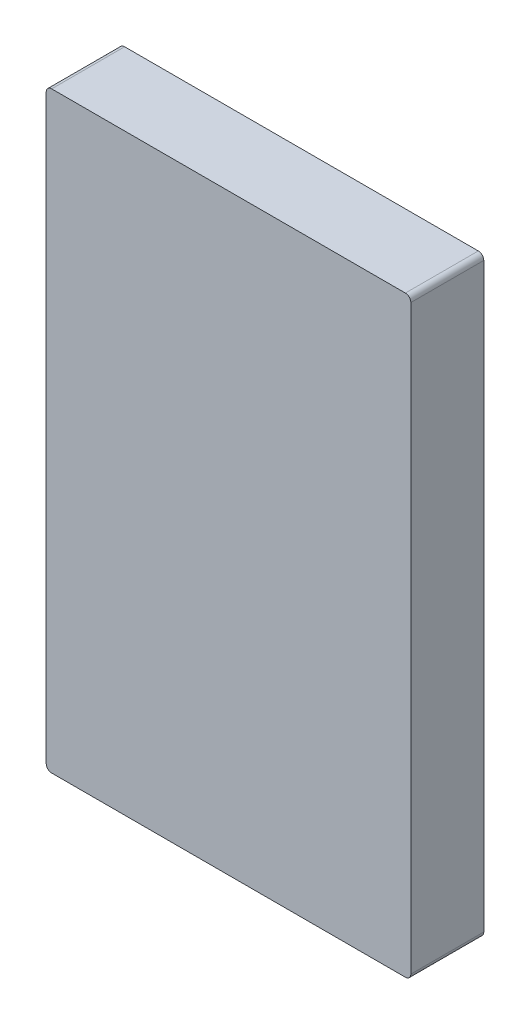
ISO-10303-21;
HEADER;
FILE_DESCRIPTION(('STEP AP214'),'2;1');
FILE_NAME('part.step','',(''),(''),'','','');
FILE_SCHEMA(('AUTOMOTIVE_DESIGN { 1 0 10303 214 1 1 1 1 }'));
ENDSEC;
DATA;
#1=APPLICATION_CONTEXT('core data for automotive mechanical design processes');
#2=APPLICATION_PROTOCOL_DEFINITION('international standard','automotive_design',2000,#1);
#3=PRODUCT_CONTEXT('',#1,'mechanical');
#4=PRODUCT('Part','Part','',(#3));
#5=PRODUCT_RELATED_PRODUCT_CATEGORY('part','',(#4));
#6=PRODUCT_DEFINITION_FORMATION('','',#4);
#7=PRODUCT_DEFINITION_CONTEXT('part definition',#1,'design');
#8=PRODUCT_DEFINITION('design','',#6,#7);
#9=PRODUCT_DEFINITION_SHAPE('','',#8);
#10=(LENGTH_UNIT() NAMED_UNIT(*) SI_UNIT(.MILLI.,.METRE.));
#11=(NAMED_UNIT(*) PLANE_ANGLE_UNIT() SI_UNIT($,.RADIAN.));
#12=(NAMED_UNIT(*) SI_UNIT($,.STERADIAN.) SOLID_ANGLE_UNIT());
#13=UNCERTAINTY_MEASURE_WITH_UNIT(LENGTH_MEASURE(1.E-05),#10,'distance_accuracy_value','');
#14=(GEOMETRIC_REPRESENTATION_CONTEXT(3) GLOBAL_UNCERTAINTY_ASSIGNED_CONTEXT((#13)) GLOBAL_UNIT_ASSIGNED_CONTEXT((#10,
#11,#12)) REPRESENTATION_CONTEXT('',''));
#15=CARTESIAN_POINT('',(0.,0.,0.));
#16=DIRECTION('',(0.,0.,1.));
#17=DIRECTION('',(1.,0.,0.));
#18=AXIS2_PLACEMENT_3D('',#15,#16,#17);
#19=CARTESIAN_POINT('',(-19.000000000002,253.999999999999,20.0000000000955));
#20=DIRECTION('',(0.,0.,-1.));
#21=DIRECTION('',(-1.,0.,0.));
#22=AXIS2_PLACEMENT_3D('',#19,#20,#21);
#23=CONICAL_SURFACE('',#22,2.06699999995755,1.02974425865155);
#24=CARTESIAN_POINT('',(-19.000000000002,253.999999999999,20.));
#25=DIRECTION('',(0.,0.,-1.));
#26=DIRECTION('',(-1.,0.,0.));
#27=AXIS2_PLACEMENT_3D('',#24,#25,#26);
#28=CIRCLE('',#27,2.067);
#29=CARTESIAN_POINT('',(-21.067000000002,253.999999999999,20.));
#30=VERTEX_POINT('',#29);
#31=EDGE_CURVE('E1176',#30,#30,#28,.T.);
#32=ORIENTED_EDGE('',*,*,#31,.T.);
#33=EDGE_LOOP('',(#32));
#34=FACE_BOUND('',#33,.T.);
#35=CARTESIAN_POINT('',(-19.000000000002,253.999999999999,21.2419788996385));
#36=VERTEX_POINT('',#35);
#37=VERTEX_LOOP('',#36);
#38=FACE_BOUND('',#37,.T.);
#39=ADVANCED_FACE('F17',(#34,#38),#23,.F.);
#40=CARTESIAN_POINT('',(18.9999999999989,-3.90798504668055E-13,20.0000000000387));
#41=DIRECTION('',(0.,0.,-1.));
#42=DIRECTION('',(-1.,0.,0.));
#43=AXIS2_PLACEMENT_3D('',#40,#41,#42);
#44=CONICAL_SURFACE('',#43,2.06700000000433,1.02974425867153);
#45=CARTESIAN_POINT('',(18.9999999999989,-3.90798504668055E-13,20.));
#46=DIRECTION('',(0.,0.,-1.));
#47=DIRECTION('',(-1.,0.,0.));
#48=AXIS2_PLACEMENT_3D('',#45,#46,#47);
#49=CIRCLE('',#48,2.067);
#50=CARTESIAN_POINT('',(16.9329999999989,-3.90798504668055E-13,20.));
#51=VERTEX_POINT('',#50);
#52=EDGE_CURVE('E1224',#51,#51,#49,.T.);
#53=ORIENTED_EDGE('',*,*,#52,.T.);
#54=EDGE_LOOP('',(#53));
#55=FACE_BOUND('',#54,.T.);
#56=CARTESIAN_POINT('',(19.0000000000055,-3.90798504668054E-13,21.2419788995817));
#57=VERTEX_POINT('',#56);
#58=VERTEX_LOOP('',#57);
#59=FACE_BOUND('',#58,.T.);
#60=ADVANCED_FACE('F384',(#55,#59),#44,.F.);
#61=CARTESIAN_POINT('',(-19.0000000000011,-6.75015598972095E-13,20.0000000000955));
#62=DIRECTION('',(0.,0.,-1.));
#63=DIRECTION('',(-1.,0.,0.));
#64=AXIS2_PLACEMENT_3D('',#61,#62,#63);
#65=CONICAL_SURFACE('',#64,2.06699999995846,1.02974425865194);
#66=CARTESIAN_POINT('',(-19.0000000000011,-6.75015598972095E-13,20.));
#67=DIRECTION('',(0.,0.,-1.));
#68=DIRECTION('',(-1.,0.,0.));
#69=AXIS2_PLACEMENT_3D('',#66,#67,#68);
#70=CIRCLE('',#69,2.067);
#71=CARTESIAN_POINT('',(-21.0670000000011,-6.75015598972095E-13,20.));
#72=VERTEX_POINT('',#71);
#73=EDGE_CURVE('E1222',#72,#72,#70,.T.);
#74=ORIENTED_EDGE('',*,*,#73,.T.);
#75=EDGE_LOOP('',(#74));
#76=FACE_BOUND('',#75,.T.);
#77=CARTESIAN_POINT('',(-19.0000000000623,-6.75015598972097E-13,21.2419788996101));
#78=VERTEX_POINT('',#77);
#79=VERTEX_LOOP('',#78);
#80=FACE_BOUND('',#79,.T.);
#81=ADVANCED_FACE('F391',(#76,#80),#65,.F.);
#82=CARTESIAN_POINT('',(18.999999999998,254.,20.0000000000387));
#83=DIRECTION('',(0.,0.,-1.));
#84=DIRECTION('',(-1.,0.,0.));
#85=AXIS2_PLACEMENT_3D('',#82,#83,#84);
#86=CONICAL_SURFACE('',#85,2.06700000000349,1.02974425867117);
#87=CARTESIAN_POINT('',(18.999999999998,254.,20.));
#88=DIRECTION('',(0.,0.,-1.));
#89=DIRECTION('',(-1.,0.,0.));
#90=AXIS2_PLACEMENT_3D('',#87,#88,#89);
#91=CIRCLE('',#90,2.067);
#92=CARTESIAN_POINT('',(16.932999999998,254.,20.));
#93=VERTEX_POINT('',#92);
#94=EDGE_CURVE('E1218',#93,#93,#91,.T.);
#95=ORIENTED_EDGE('',*,*,#94,.T.);
#96=EDGE_LOOP('',(#95));
#97=FACE_BOUND('',#96,.T.);
#98=CARTESIAN_POINT('',(18.999999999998,254.,21.2419788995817));
#99=VERTEX_POINT('',#98);
#100=VERTEX_LOOP('',#99);
#101=FACE_BOUND('',#100,.T.);
#102=ADVANCED_FACE('F1064',(#97,#101),#86,.F.);
#103=CARTESIAN_POINT('',(42.0026864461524,-30.0347539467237,30.));
#104=DIRECTION('',(0.,0.,1.));
#105=DIRECTION('',(1.,0.,0.));
#106=AXIS2_PLACEMENT_3D('',#103,#104,#105);
#107=PLANE('',#106);
#108=DIRECTION('',(1.,0.,0.));
#109=VECTOR('',#108,1.);
#110=CARTESIAN_POINT('',(-19.0000000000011,8.5722333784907,30.));
#111=LINE('',#110,#109);
#112=CARTESIAN_POINT('',(-16.5000000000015,8.5722333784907,30.));
#113=VERTEX_POINT('',#112);
#114=CARTESIAN_POINT('',(16.4999999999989,8.57223337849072,30.));
#115=VERTEX_POINT('',#114);
#116=EDGE_CURVE('E252',#113,#115,#111,.T.);
#117=ORIENTED_EDGE('',*,*,#116,.F.);
#118=DIRECTION('',(0.,1.,0.));
#119=VECTOR('',#118,1.);
#120=CARTESIAN_POINT('',(-16.5000000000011,6.99999999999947,30.));
#121=LINE('',#120,#119);
#122=CARTESIAN_POINT('',(-16.5000000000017,245.427766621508,30.));
#123=VERTEX_POINT('',#122);
#124=EDGE_CURVE('E1651',#123,#113,#121,.F.);
#125=ORIENTED_EDGE('',*,*,#124,.F.);
#126=DIRECTION('',(1.,0.,0.));
#127=VECTOR('',#126,1.);
#128=CARTESIAN_POINT('',(18.999999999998,245.427766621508,30.));
#129=LINE('',#128,#127);
#130=CARTESIAN_POINT('',(16.4999999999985,245.427766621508,30.));
#131=VERTEX_POINT('',#130);
#132=EDGE_CURVE('E1221',#131,#123,#129,.F.);
#133=ORIENTED_EDGE('',*,*,#132,.F.);
#134=DIRECTION('',(0.,-1.,0.));
#135=VECTOR('',#134,1.);
#136=CARTESIAN_POINT('',(16.499999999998,247.,30.));
#137=LINE('',#136,#135);
#138=EDGE_CURVE('E1677',#115,#131,#137,.F.);
#139=ORIENTED_EDGE('',*,*,#138,.F.);
#140=EDGE_LOOP('',(#117,#125,#133,#139));
#141=FACE_BOUND('',#140,.T.);
#142=ADVANCED_FACE('F1057',(#141),#107,.F.);
#143=CARTESIAN_POINT('',(24.4996848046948,-298.182269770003,-12.7925984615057));
#144=DIRECTION('',(1.,-6.12147278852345E-09,0.));
#145=DIRECTION('',(6.12147278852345E-09,1.,0.));
#146=AXIS2_PLACEMENT_3D('',#143,#144,#145);
#147=PLANE('',#146);
#148=DIRECTION('',(0.,1.,0.));
#149=VECTOR('',#148,1.);
#150=CARTESIAN_POINT('',(24.4996848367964,-292.938172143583,-10.2640987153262));
#151=LINE('',#150,#149);
#152=CARTESIAN_POINT('',(24.4996848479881,-292.938172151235,-10.264098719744));
#153=VERTEX_POINT('',#152);
#154=CARTESIAN_POINT('',(24.4996847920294,-303.907827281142,-10.2640987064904));
#155=VERTEX_POINT('',#154);
#156=EDGE_CURVE('E1198',#153,#155,#151,.F.);
#157=ORIENTED_EDGE('',*,*,#156,.F.);
#158=DIRECTION('',(0.,0.499999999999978,-0.866025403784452));
#159=VECTOR('',#158,1.);
#160=CARTESIAN_POINT('',(24.4996848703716,-287.453344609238,-19.7640987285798));
#161=LINE('',#160,#159);
#162=CARTESIAN_POINT('',(24.4996848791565,-287.453344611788,-19.764098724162));
#163=VERTEX_POINT('',#162);
#164=EDGE_CURVE('E1208',#163,#153,#161,.F.);
#165=ORIENTED_EDGE('',*,*,#164,.F.);
#166=DIRECTION('',(0.,1.,0.));
#167=VECTOR('',#166,1.);
#168=CARTESIAN_POINT('',(24.4996848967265,-283.148029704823,-19.7640987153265));
#169=LINE('',#168,#167);
#170=CARTESIAN_POINT('',(24.4996848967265,-283.148029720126,-19.7640987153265));
#171=VERTEX_POINT('',#170);
#172=EDGE_CURVE('E236',#171,#163,#169,.F.);
#173=ORIENTED_EDGE('',*,*,#172,.F.);
#174=CARTESIAN_POINT('',(24.4996848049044,-298.14802973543,-19.7640987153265));
#175=DIRECTION('',(-1.,6.12147251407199E-09,0.));
#176=DIRECTION('',(-6.12147251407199E-09,-1.,0.));
#177=AXIS2_PLACEMENT_3D('',#174,#175,#176);
#178=CIRCLE('',#177,15.);
#179=CARTESIAN_POINT('',(24.4996847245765,-313.14802973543,-19.7640987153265));
#180=VERTEX_POINT('',#179);
#181=EDGE_CURVE('E21',#171,#180,#178,.F.);
#182=ORIENTED_EDGE('',*,*,#181,.T.);
#183=DIRECTION('',(0.,1.,1.89206871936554E-13));
#184=VECTOR('',#183,1.);
#185=CARTESIAN_POINT('',(24.4996847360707,-309.392654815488,-19.7640987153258));
#186=LINE('',#185,#184);
#187=CARTESIAN_POINT('',(24.4996847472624,-309.39265482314,-19.764098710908));
#188=VERTEX_POINT('',#187);
#189=EDGE_CURVE('E1177',#188,#180,#186,.F.);
#190=ORIENTED_EDGE('',*,*,#189,.F.);
#191=DIRECTION('',(0.,0.500000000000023,0.866025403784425));
#192=VECTOR('',#191,1.);
#193=CARTESIAN_POINT('',(24.4996847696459,-303.907827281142,-10.2640987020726));
#194=LINE('',#193,#192);
#195=EDGE_CURVE('E1188',#155,#188,#194,.F.);
#196=ORIENTED_EDGE('',*,*,#195,.F.);
#197=EDGE_LOOP('',(#157,#165,#173,#182,#190,#196));
#198=FACE_BOUND('',#197,.T.);
#199=ADVANCED_FACE('F1049',(#198),#147,.T.);
#200=CARTESIAN_POINT('',(19.4996848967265,-283.148029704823,-19.7640987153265));
#201=DIRECTION('',(0.,0.,-1.));
#202=DIRECTION('',(0.,1.,0.));
#203=AXIS2_PLACEMENT_3D('',#200,#201,#202);
#204=PLANE('',#203);
#205=DIRECTION('',(6.12147279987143E-09,1.,0.));
#206=VECTOR('',#205,1.);
#207=CARTESIAN_POINT('',(19.4996848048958,-298.149431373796,-19.7640987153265));
#208=LINE('',#207,#206);
#209=CARTESIAN_POINT('',(19.4996848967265,-283.148029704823,-19.7640987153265));
#210=VERTEX_POINT('',#209);
#211=CARTESIAN_POINT('',(19.4996848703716,-287.453344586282,-19.7640987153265));
#212=VERTEX_POINT('',#211);
#213=EDGE_CURVE('E1160',#210,#212,#208,.F.);
#214=ORIENTED_EDGE('',*,*,#213,.F.);
#215=DIRECTION('',(-1.,6.12147251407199E-09,0.));
#216=VECTOR('',#215,1.);
#217=CARTESIAN_POINT('',(49.4996848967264,-283.148029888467,-19.7640987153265));
#218=LINE('',#217,#216);
#219=EDGE_CURVE('E1155',#210,#171,#218,.F.);
#220=ORIENTED_EDGE('',*,*,#219,.T.);
#221=ORIENTED_EDGE('',*,*,#172,.T.);
#222=DIRECTION('',(1.,-4.59110616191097E-09,-2.65067637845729E-09));
#223=VECTOR('',#222,1.);
#224=CARTESIAN_POINT('',(19.4996848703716,-287.453344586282,-19.7640987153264));
#225=LINE('',#224,#223);
#226=EDGE_CURVE('E1205',#212,#163,#225,.T.);
#227=ORIENTED_EDGE('',*,*,#226,.F.);
#228=EDGE_LOOP('',(#214,#220,#221,#227));
#229=FACE_BOUND('',#228,.T.);
#230=ADVANCED_FACE('F1041',(#229),#204,.T.);
#231=CARTESIAN_POINT('',(19.4996848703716,-287.453344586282,-19.7640987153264));
#232=DIRECTION('',(-5.30135275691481E-09,-0.866025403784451,-0.499999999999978));
#233=DIRECTION('',(0.,0.499999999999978,-0.866025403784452));
#234=AXIS2_PLACEMENT_3D('',#231,#232,#233);
#235=PLANE('',#234);
#236=DIRECTION('',(-3.06073637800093E-09,-0.499999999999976,0.866025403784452));
#237=VECTOR('',#236,1.);
#238=CARTESIAN_POINT('',(19.4996848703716,-287.453344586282,-19.7640987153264));
#239=LINE('',#238,#237);
#240=CARTESIAN_POINT('',(19.4996848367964,-292.938172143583,-10.2640987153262));
#241=VERTEX_POINT('',#240);
#242=EDGE_CURVE('E1162',#212,#241,#239,.T.);
#243=ORIENTED_EDGE('',*,*,#242,.F.);
#244=ORIENTED_EDGE('',*,*,#226,.T.);
#245=ORIENTED_EDGE('',*,*,#164,.T.);
#246=DIRECTION('',(1.,0.,0.));
#247=VECTOR('',#246,1.);
#248=CARTESIAN_POINT('',(19.4996848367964,-292.938172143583,-10.2640987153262));
#249=LINE('',#248,#247);
#250=EDGE_CURVE('E1195',#241,#153,#249,.T.);
#251=ORIENTED_EDGE('',*,*,#250,.F.);
#252=EDGE_LOOP('',(#243,#244,#245,#251));
#253=FACE_BOUND('',#252,.T.);
#254=ADVANCED_FACE('F1033',(#253),#235,.T.);
#255=CARTESIAN_POINT('',(19.4996848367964,-292.938172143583,-10.2640987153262));
#256=DIRECTION('',(0.,0.,-1.));
#257=DIRECTION('',(0.,1.,0.));
#258=AXIS2_PLACEMENT_3D('',#255,#256,#257);
#259=PLANE('',#258);
#260=DIRECTION('',(6.12147279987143E-09,1.,0.));
#261=VECTOR('',#260,1.);
#262=CARTESIAN_POINT('',(19.4996848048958,-298.149431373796,-10.2640987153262));
#263=LINE('',#262,#261);
#264=CARTESIAN_POINT('',(19.4996847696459,-303.907827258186,-10.2640987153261));
#265=VERTEX_POINT('',#264);
#266=EDGE_CURVE('E1182',#241,#265,#263,.F.);
#267=ORIENTED_EDGE('',*,*,#266,.F.);
#268=ORIENTED_EDGE('',*,*,#250,.T.);
#269=ORIENTED_EDGE('',*,*,#156,.T.);
#270=DIRECTION('',(1.,-4.59110616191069E-09,2.65067637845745E-09));
#271=VECTOR('',#270,1.);
#272=CARTESIAN_POINT('',(19.4996847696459,-303.907827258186,-10.264098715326));
#273=LINE('',#272,#271);
#274=EDGE_CURVE('E1185',#265,#155,#273,.T.);
#275=ORIENTED_EDGE('',*,*,#274,.F.);
#276=EDGE_LOOP('',(#267,#268,#269,#275));
#277=FACE_BOUND('',#276,.T.);
#278=ADVANCED_FACE('F1025',(#277),#259,.T.);
#279=CARTESIAN_POINT('',(19.4996847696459,-303.907827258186,-10.264098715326));
#280=DIRECTION('',(5.30135275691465E-09,0.866025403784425,-0.500000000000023));
#281=DIRECTION('',(0.,0.500000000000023,0.866025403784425));
#282=AXIS2_PLACEMENT_3D('',#279,#280,#281);
#283=PLANE('',#282);
#284=DIRECTION('',(-3.06073669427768E-09,-0.500000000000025,-0.866025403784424));
#285=VECTOR('',#284,1.);
#286=CARTESIAN_POINT('',(19.4996847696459,-303.907827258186,-10.264098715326));
#287=LINE('',#286,#285);
#288=CARTESIAN_POINT('',(19.4996847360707,-309.392654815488,-19.7640987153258));
#289=VERTEX_POINT('',#288);
#290=EDGE_CURVE('E1170',#265,#289,#287,.T.);
#291=ORIENTED_EDGE('',*,*,#290,.F.);
#292=ORIENTED_EDGE('',*,*,#274,.T.);
#293=ORIENTED_EDGE('',*,*,#195,.T.);
#294=DIRECTION('',(1.,0.,0.));
#295=VECTOR('',#294,1.);
#296=CARTESIAN_POINT('',(19.4996847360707,-309.392654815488,-19.7640987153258));
#297=LINE('',#296,#295);
#298=EDGE_CURVE('E1173',#289,#188,#297,.T.);
#299=ORIENTED_EDGE('',*,*,#298,.F.);
#300=EDGE_LOOP('',(#291,#292,#293,#299));
#301=FACE_BOUND('',#300,.T.);
#302=ADVANCED_FACE('F1017',(#301),#283,.T.);
#303=CARTESIAN_POINT('',(19.4996847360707,-309.392654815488,-19.7640987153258));
#304=DIRECTION('',(0.,1.89206871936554E-13,-1.));
#305=DIRECTION('',(0.,1.,1.89206871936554E-13));
#306=AXIS2_PLACEMENT_3D('',#303,#304,#305);
#307=PLANE('',#306);
#308=DIRECTION('',(6.12147279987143E-09,1.,0.));
#309=VECTOR('',#308,1.);
#310=CARTESIAN_POINT('',(19.4996848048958,-298.149431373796,-19.7640987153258));
#311=LINE('',#310,#309);
#312=CARTESIAN_POINT('',(19.4996847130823,-313.148029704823,-19.764098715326));
#313=VERTEX_POINT('',#312);
#314=EDGE_CURVE('E1142',#289,#313,#311,.F.);
#315=ORIENTED_EDGE('',*,*,#314,.F.);
#316=ORIENTED_EDGE('',*,*,#298,.T.);
#317=ORIENTED_EDGE('',*,*,#189,.T.);
#318=DIRECTION('',(1.,-6.12147251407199E-09,0.));
#319=VECTOR('',#318,1.);
#320=CARTESIAN_POINT('',(49.4996847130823,-313.148029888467,-19.7640987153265));
#321=LINE('',#320,#319);
#322=EDGE_CURVE('E1154',#180,#313,#321,.F.);
#323=ORIENTED_EDGE('',*,*,#322,.T.);
#324=EDGE_LOOP('',(#315,#316,#317,#323));
#325=FACE_BOUND('',#324,.T.);
#326=ADVANCED_FACE('F1009',(#325),#307,.T.);
#327=CARTESIAN_POINT('',(-19.000000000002,253.999999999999,10.));
#328=DIRECTION('',(0.,0.,-1.));
#329=DIRECTION('',(-1.,0.,0.));
#330=AXIS2_PLACEMENT_3D('',#327,#328,#329);
#331=CYLINDRICAL_SURFACE('',#330,2.067);
#332=ORIENTED_EDGE('',*,*,#31,.F.);
#333=EDGE_LOOP('',(#332));
#334=FACE_BOUND('',#333,.T.);
#335=CARTESIAN_POINT('',(-19.000000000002,253.999999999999,0.686000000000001));
#336=DIRECTION('',(0.,0.,-1.));
#337=DIRECTION('',(-1.,0.,0.));
#338=AXIS2_PLACEMENT_3D('',#335,#336,#337);
#339=CIRCLE('',#338,2.067);
#340=CARTESIAN_POINT('',(-21.067000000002,253.999999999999,0.686000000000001));
#341=VERTEX_POINT('',#340);
#342=EDGE_CURVE('E1131',#341,#341,#339,.T.);
#343=ORIENTED_EDGE('',*,*,#342,.T.);
#344=EDGE_LOOP('',(#343));
#345=FACE_BOUND('',#344,.T.);
#346=ADVANCED_FACE('F1001',(#334,#345),#331,.F.);
#347=CARTESIAN_POINT('',(18.9999999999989,-3.90798504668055E-13,10.));
#348=DIRECTION('',(0.,0.,-1.));
#349=DIRECTION('',(-1.,0.,0.));
#350=AXIS2_PLACEMENT_3D('',#347,#348,#349);
#351=CYLINDRICAL_SURFACE('',#350,2.067);
#352=ORIENTED_EDGE('',*,*,#52,.F.);
#353=EDGE_LOOP('',(#352));
#354=FACE_BOUND('',#353,.T.);
#355=CARTESIAN_POINT('',(18.9999999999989,-3.90798504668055E-13,0.686000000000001));
#356=DIRECTION('',(0.,0.,-1.));
#357=DIRECTION('',(-1.,0.,0.));
#358=AXIS2_PLACEMENT_3D('',#355,#356,#357);
#359=CIRCLE('',#358,2.067);
#360=CARTESIAN_POINT('',(16.9329999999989,-3.90798504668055E-13,0.686000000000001));
#361=VERTEX_POINT('',#360);
#362=EDGE_CURVE('E1129',#361,#361,#359,.T.);
#363=ORIENTED_EDGE('',*,*,#362,.T.);
#364=EDGE_LOOP('',(#363));
#365=FACE_BOUND('',#364,.T.);
#366=ADVANCED_FACE('F993',(#354,#365),#351,.F.);
#367=CARTESIAN_POINT('',(-19.0000000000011,-6.75015598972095E-13,10.));
#368=DIRECTION('',(0.,0.,-1.));
#369=DIRECTION('',(-1.,0.,0.));
#370=AXIS2_PLACEMENT_3D('',#367,#368,#369);
#371=CYLINDRICAL_SURFACE('',#370,2.067);
#372=ORIENTED_EDGE('',*,*,#73,.F.);
#373=EDGE_LOOP('',(#372));
#374=FACE_BOUND('',#373,.T.);
#375=CARTESIAN_POINT('',(-19.0000000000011,-6.75015598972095E-13,0.686000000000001));
#376=DIRECTION('',(0.,0.,-1.));
#377=DIRECTION('',(-1.,0.,0.));
#378=AXIS2_PLACEMENT_3D('',#375,#376,#377);
#379=CIRCLE('',#378,2.067);
#380=CARTESIAN_POINT('',(-21.0670000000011,-6.75015598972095E-13,0.686000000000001));
#381=VERTEX_POINT('',#380);
#382=EDGE_CURVE('E1126',#381,#381,#379,.T.);
#383=ORIENTED_EDGE('',*,*,#382,.T.);
#384=EDGE_LOOP('',(#383));
#385=FACE_BOUND('',#384,.T.);
#386=ADVANCED_FACE('F985',(#374,#385),#371,.F.);
#387=CARTESIAN_POINT('',(18.999999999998,254.,10.));
#388=DIRECTION('',(0.,0.,-1.));
#389=DIRECTION('',(-1.,0.,0.));
#390=AXIS2_PLACEMENT_3D('',#387,#388,#389);
#391=CYLINDRICAL_SURFACE('',#390,2.067);
#392=ORIENTED_EDGE('',*,*,#94,.F.);
#393=EDGE_LOOP('',(#392));
#394=FACE_BOUND('',#393,.T.);
#395=CARTESIAN_POINT('',(18.999999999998,254.,0.686000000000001));
#396=DIRECTION('',(0.,0.,-1.));
#397=DIRECTION('',(-1.,0.,0.));
#398=AXIS2_PLACEMENT_3D('',#395,#396,#397);
#399=CIRCLE('',#398,2.067);
#400=CARTESIAN_POINT('',(16.932999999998,254.,0.686000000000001));
#401=VERTEX_POINT('',#400);
#402=EDGE_CURVE('E1122',#401,#401,#399,.T.);
#403=ORIENTED_EDGE('',*,*,#402,.T.);
#404=EDGE_LOOP('',(#403));
#405=FACE_BOUND('',#404,.T.);
#406=ADVANCED_FACE('F977',(#394,#405),#391,.F.);
#407=CARTESIAN_POINT('',(18.999999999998,247.,0.));
#408=DIRECTION('',(0.,-0.998629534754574,-0.0523359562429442));
#409=DIRECTION('',(0.,0.0523359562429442,-0.998629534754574));
#410=AXIS2_PLACEMENT_3D('',#407,#408,#409);
#411=PLANE('',#410);
#412=ORIENTED_EDGE('',*,*,#132,.T.);
#413=DIRECTION('',(0.,-0.0523359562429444,0.998629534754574));
#414=VECTOR('',#413,1.);
#415=CARTESIAN_POINT('',(-16.5000000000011,246.964048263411,0.686));
#416=LINE('',#415,#414);
#417=CARTESIAN_POINT('',(-16.5000000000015,246.964048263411,0.686));
#418=VERTEX_POINT('',#417);
#419=EDGE_CURVE('E1656',#418,#123,#416,.T.);
#420=ORIENTED_EDGE('',*,*,#419,.F.);
#421=DIRECTION('',(1.,0.,0.));
#422=VECTOR('',#421,1.);
#423=CARTESIAN_POINT('',(-1.54279367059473E-12,246.964048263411,0.686));
#424=LINE('',#423,#422);
#425=CARTESIAN_POINT('',(16.499999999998,246.964048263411,0.686000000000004));
#426=VERTEX_POINT('',#425);
#427=EDGE_CURVE('E1125',#418,#426,#424,.T.);
#428=ORIENTED_EDGE('',*,*,#427,.T.);
#429=DIRECTION('',(0.,0.0523359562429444,-0.998629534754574));
#430=VECTOR('',#429,1.);
#431=CARTESIAN_POINT('',(16.4999999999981,245.427766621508,30.));
#432=LINE('',#431,#430);
#433=EDGE_CURVE('E1672',#131,#426,#432,.T.);
#434=ORIENTED_EDGE('',*,*,#433,.F.);
#435=EDGE_LOOP('',(#412,#420,#428,#434));
#436=FACE_BOUND('',#435,.T.);
#437=ADVANCED_FACE('F969',(#436),#411,.T.);
#438=CARTESIAN_POINT('',(16.499999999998,247.,0.));
#439=DIRECTION('',(-1.,0.,0.));
#440=DIRECTION('',(0.,-1.,0.));
#441=AXIS2_PLACEMENT_3D('',#438,#439,#440);
#442=PLANE('',#441);
#443=ORIENTED_EDGE('',*,*,#138,.T.);
#444=ORIENTED_EDGE('',*,*,#433,.T.);
#445=DIRECTION('',(0.,1.,0.));
#446=VECTOR('',#445,1.);
#447=CARTESIAN_POINT('',(16.499999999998,126.999999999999,0.686));
#448=LINE('',#447,#446);
#449=CARTESIAN_POINT('',(16.4999999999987,7.03595173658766,0.685999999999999));
#450=VERTEX_POINT('',#449);
#451=EDGE_CURVE('E1667',#426,#450,#448,.F.);
#452=ORIENTED_EDGE('',*,*,#451,.T.);
#453=DIRECTION('',(0.,0.0523359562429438,0.998629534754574));
#454=VECTOR('',#453,1.);
#455=CARTESIAN_POINT('',(16.4999999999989,6.99999999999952,0.));
#456=LINE('',#455,#454);
#457=EDGE_CURVE('E1663',#115,#450,#456,.F.);
#458=ORIENTED_EDGE('',*,*,#457,.F.);
#459=EDGE_LOOP('',(#443,#444,#452,#458));
#460=FACE_BOUND('',#459,.T.);
#461=ADVANCED_FACE('F961',(#460),#442,.T.);
#462=CARTESIAN_POINT('',(-19.0000000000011,6.99999999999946,0.));
#463=DIRECTION('',(0.,0.998629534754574,-0.0523359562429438));
#464=DIRECTION('',(0.,0.0523359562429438,0.998629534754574));
#465=AXIS2_PLACEMENT_3D('',#462,#463,#464);
#466=PLANE('',#465);
#467=ORIENTED_EDGE('',*,*,#116,.T.);
#468=ORIENTED_EDGE('',*,*,#457,.T.);
#469=DIRECTION('',(1.,0.,0.));
#470=VECTOR('',#469,1.);
#471=CARTESIAN_POINT('',(-1.54279367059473E-12,7.03595173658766,0.686));
#472=LINE('',#471,#470);
#473=CARTESIAN_POINT('',(-16.5000000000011,7.03595173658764,0.685999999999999));
#474=VERTEX_POINT('',#473);
#475=EDGE_CURVE('E1665',#450,#474,#472,.F.);
#476=ORIENTED_EDGE('',*,*,#475,.T.);
#477=DIRECTION('',(0.,-0.0523359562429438,-0.998629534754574));
#478=VECTOR('',#477,1.);
#479=CARTESIAN_POINT('',(-16.5000000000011,8.5722333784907,30.));
#480=LINE('',#479,#478);
#481=EDGE_CURVE('E1649',#113,#474,#480,.T.);
#482=ORIENTED_EDGE('',*,*,#481,.F.);
#483=EDGE_LOOP('',(#467,#468,#476,#482));
#484=FACE_BOUND('',#483,.T.);
#485=ADVANCED_FACE('F953',(#484),#466,.T.);
#486=CARTESIAN_POINT('',(-16.5000000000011,6.99999999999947,0.));
#487=DIRECTION('',(1.,0.,0.));
#488=DIRECTION('',(0.,0.,-1.));
#489=AXIS2_PLACEMENT_3D('',#486,#487,#488);
#490=PLANE('',#489);
#491=ORIENTED_EDGE('',*,*,#124,.T.);
#492=ORIENTED_EDGE('',*,*,#481,.T.);
#493=DIRECTION('',(0.,1.,0.));
#494=VECTOR('',#493,1.);
#495=CARTESIAN_POINT('',(-16.5000000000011,126.999999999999,0.686));
#496=LINE('',#495,#494);
#497=EDGE_CURVE('E1543',#474,#418,#496,.T.);
#498=ORIENTED_EDGE('',*,*,#497,.T.);
#499=ORIENTED_EDGE('',*,*,#419,.T.);
#500=EDGE_LOOP('',(#491,#492,#498,#499));
#501=FACE_BOUND('',#500,.T.);
#502=ADVANCED_FACE('F945',(#501),#490,.T.);
#503=CARTESIAN_POINT('',(49.4996848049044,-298.148029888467,-19.7640987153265));
#504=DIRECTION('',(-1.,6.12147251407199E-09,0.));
#505=DIRECTION('',(-6.12147251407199E-09,-1.,0.));
#506=AXIS2_PLACEMENT_3D('',#503,#504,#505);
#507=CYLINDRICAL_SURFACE('',#506,15.);
#508=DIRECTION('',(-1.,6.12147251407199E-09,0.));
#509=VECTOR('',#508,1.);
#510=CARTESIAN_POINT('',(49.4996848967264,-283.148029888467,-19.7640987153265));
#511=LINE('',#510,#509);
#512=CARTESIAN_POINT('',(29.4996848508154,-283.148029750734,-19.7640987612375));
#513=VERTEX_POINT('',#512);
#514=EDGE_CURVE('E1157',#171,#513,#511,.F.);
#515=ORIENTED_EDGE('',*,*,#514,.T.);
#516=CARTESIAN_POINT('',(29.4996848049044,-298.148029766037,-19.7640987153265));
#517=DIRECTION('',(-0.707106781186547,4.32853526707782E-09,0.707106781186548));
#518=DIRECTION('',(-0.707106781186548,4.32853418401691E-09,-0.707106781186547));
#519=AXIS2_PLACEMENT_3D('',#516,#517,#518);
#520=ELLIPSE('',#519,21.2132034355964,15.);
#521=CARTESIAN_POINT('',(29.4996847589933,-313.148029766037,-19.7640986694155));
#522=VERTEX_POINT('',#521);
#523=EDGE_CURVE('E1118',#513,#522,#520,.F.);
#524=ORIENTED_EDGE('',*,*,#523,.T.);
#525=DIRECTION('',(1.,-6.12147251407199E-09,0.));
#526=VECTOR('',#525,1.);
#527=CARTESIAN_POINT('',(49.4996847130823,-313.148029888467,-19.7640987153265));
#528=LINE('',#527,#526);
#529=EDGE_CURVE('E1152',#522,#180,#528,.F.);
#530=ORIENTED_EDGE('',*,*,#529,.T.);
#531=ORIENTED_EDGE('',*,*,#181,.F.);
#532=EDGE_LOOP('',(#515,#524,#530,#531));
#533=FACE_BOUND('',#532,.T.);
#534=ADVANCED_FACE('F937',(#533),#507,.F.);
#535=CARTESIAN_POINT('',(49.4996847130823,-313.148029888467,-19.7640987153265));
#536=DIRECTION('',(-6.12147251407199E-09,-1.,0.));
#537=DIRECTION('',(1.,-6.12147251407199E-09,0.));
#538=AXIS2_PLACEMENT_3D('',#535,#536,#537);
#539=PLANE('',#538);
#540=DIRECTION('',(0.,0.,1.));
#541=VECTOR('',#540,1.);
#542=CARTESIAN_POINT('',(19.4996847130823,-313.148029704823,-23.0633811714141));
#543=LINE('',#542,#541);
#544=CARTESIAN_POINT('',(19.4996847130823,-313.148029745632,-29.7640987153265));
#545=VERTEX_POINT('',#544);
#546=EDGE_CURVE('E1137',#313,#545,#543,.F.);
#547=ORIENTED_EDGE('',*,*,#546,.F.);
#548=ORIENTED_EDGE('',*,*,#322,.F.);
#549=ORIENTED_EDGE('',*,*,#529,.F.);
#550=DIRECTION('',(0.707106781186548,0.,0.707106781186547));
#551=VECTOR('',#550,1.);
#552=CARTESIAN_POINT('',(9.4996848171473,-313.148029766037,-39.7640986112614));
#553=LINE('',#552,#551);
#554=EDGE_CURVE('E1120',#522,#545,#553,.F.);
#555=ORIENTED_EDGE('',*,*,#554,.T.);
#556=EDGE_LOOP('',(#547,#548,#549,#555));
#557=FACE_BOUND('',#556,.T.);
#558=ADVANCED_FACE('F929',(#557),#539,.F.);
#559=CARTESIAN_POINT('',(49.4996848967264,-283.148029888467,-32.9928552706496));
#560=DIRECTION('',(6.12147251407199E-09,1.,0.));
#561=DIRECTION('',(-1.,6.12147251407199E-09,0.));
#562=AXIS2_PLACEMENT_3D('',#559,#560,#561);
#563=PLANE('',#562);
#564=ORIENTED_EDGE('',*,*,#514,.F.);
#565=ORIENTED_EDGE('',*,*,#219,.F.);
#566=DIRECTION('',(0.,0.,1.));
#567=VECTOR('',#566,1.);
#568=CARTESIAN_POINT('',(19.4996848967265,-283.148029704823,-23.0633811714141));
#569=LINE('',#568,#567);
#570=CARTESIAN_POINT('',(19.4996848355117,-283.148029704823,-29.7640987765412));
#571=VERTEX_POINT('',#570);
#572=EDGE_CURVE('E1133',#571,#210,#569,.T.);
#573=ORIENTED_EDGE('',*,*,#572,.F.);
#574=DIRECTION('',(0.707106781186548,0.,0.707106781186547));
#575=VECTOR('',#574,1.);
#576=CARTESIAN_POINT('',(9.4996849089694,-283.148029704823,-39.7640987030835));
#577=LINE('',#576,#575);
#578=EDGE_CURVE('E1244',#571,#513,#577,.T.);
#579=ORIENTED_EDGE('',*,*,#578,.T.);
#580=EDGE_LOOP('',(#564,#565,#573,#579));
#581=FACE_BOUND('',#580,.T.);
#582=ADVANCED_FACE('F921',(#581),#563,.F.);
#583=CARTESIAN_POINT('',(19.4996848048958,-298.149431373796,-23.0633811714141));
#584=DIRECTION('',(1.,-6.12147279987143E-09,0.));
#585=DIRECTION('',(6.12147279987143E-09,1.,0.));
#586=AXIS2_PLACEMENT_3D('',#583,#584,#585);
#587=PLANE('',#586);
#588=DIRECTION('',(3.06073663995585E-09,1.,-3.06073663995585E-09));
#589=VECTOR('',#588,1.);
#590=CARTESIAN_POINT('',(19.4996848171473,-279.148029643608,-29.7640988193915));
#591=LINE('',#590,#589);
#592=EDGE_CURVE('E1250',#545,#571,#591,.T.);
#593=ORIENTED_EDGE('',*,*,#592,.T.);
#594=ORIENTED_EDGE('',*,*,#572,.T.);
#595=ORIENTED_EDGE('',*,*,#213,.T.);
#596=ORIENTED_EDGE('',*,*,#242,.T.);
#597=ORIENTED_EDGE('',*,*,#266,.T.);
#598=ORIENTED_EDGE('',*,*,#290,.T.);
#599=ORIENTED_EDGE('',*,*,#314,.T.);
#600=ORIENTED_EDGE('',*,*,#546,.T.);
#601=EDGE_LOOP('',(#593,#594,#595,#596,#597,#598,#599,#600));
#602=FACE_BOUND('',#601,.T.);
#603=CARTESIAN_POINT('',(19.4996848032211,-298.422999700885,-19.7640987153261));
#604=DIRECTION('',(1.,-6.12147369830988E-09,0.));
#605=DIRECTION('',(6.12147369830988E-09,1.,0.));
#606=AXIS2_PLACEMENT_3D('',#603,#604,#605);
#607=CIRCLE('',#606,6.);
#608=CARTESIAN_POINT('',(19.49968483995,-292.422999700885,-19.7640987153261));
#609=VERTEX_POINT('',#608);
#610=EDGE_CURVE('E1114',#609,#609,#607,.F.);
#611=ORIENTED_EDGE('',*,*,#610,.T.);
#612=EDGE_LOOP('',(#611));
#613=FACE_BOUND('',#612,.T.);
#614=ADVANCED_FACE('F913',(#602,#613),#587,.T.);
#615=CARTESIAN_POINT('',(-1.54279367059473E-12,126.999999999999,0.686));
#616=DIRECTION('',(0.,0.,1.));
#617=DIRECTION('',(1.,0.,0.));
#618=AXIS2_PLACEMENT_3D('',#615,#616,#617);
#619=PLANE('',#618);
#620=ORIENTED_EDGE('',*,*,#475,.F.);
#621=ORIENTED_EDGE('',*,*,#451,.F.);
#622=ORIENTED_EDGE('',*,*,#427,.F.);
#623=ORIENTED_EDGE('',*,*,#497,.F.);
#624=EDGE_LOOP('',(#620,#621,#622,#623));
#625=FACE_BOUND('',#624,.T.);
#626=CARTESIAN_POINT('',(-19.000000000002,253.999999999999,0.685999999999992));
#627=DIRECTION('',(0.,0.,1.));
#628=DIRECTION('',(1.,0.,0.));
#629=AXIS2_PLACEMENT_3D('',#626,#627,#628);
#630=CIRCLE('',#629,7.03595173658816);
#631=CARTESIAN_POINT('',(-19.000000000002,261.035951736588,0.685999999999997));
#632=VERTEX_POINT('',#631);
#633=CARTESIAN_POINT('',(-21.500000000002,247.423175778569,0.685999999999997));
#634=VERTEX_POINT('',#633);
#635=EDGE_CURVE('E1099',#632,#634,#630,.T.);
#636=ORIENTED_EDGE('',*,*,#635,.F.);
#637=DIRECTION('',(1.,0.,0.));
#638=VECTOR('',#637,1.);
#639=CARTESIAN_POINT('',(-19.000000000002,261.035951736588,0.686000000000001));
#640=LINE('',#639,#638);
#641=CARTESIAN_POINT('',(18.999999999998,261.035951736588,0.685999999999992));
#642=VERTEX_POINT('',#641);
#643=EDGE_CURVE('E1434',#642,#632,#640,.F.);
#644=ORIENTED_EDGE('',*,*,#643,.F.);
#645=CARTESIAN_POINT('',(18.999999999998,254.,0.685999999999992));
#646=DIRECTION('',(0.,0.,1.));
#647=DIRECTION('',(1.,0.,0.));
#648=AXIS2_PLACEMENT_3D('',#645,#646,#647);
#649=CIRCLE('',#648,7.03595173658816);
#650=CARTESIAN_POINT('',(21.4999999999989,247.423175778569,0.686000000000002));
#651=VERTEX_POINT('',#650);
#652=EDGE_CURVE('E1430',#651,#642,#649,.T.);
#653=ORIENTED_EDGE('',*,*,#652,.F.);
#654=DIRECTION('',(0.,1.,0.));
#655=VECTOR('',#654,1.);
#656=CARTESIAN_POINT('',(21.4999999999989,6.99999999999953,0.686));
#657=LINE('',#656,#655);
#658=CARTESIAN_POINT('',(21.4999999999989,6.57682422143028,0.685999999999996));
#659=VERTEX_POINT('',#658);
#660=EDGE_CURVE('E1270',#659,#651,#657,.T.);
#661=ORIENTED_EDGE('',*,*,#660,.F.);
#662=CARTESIAN_POINT('',(18.9999999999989,-4.61436444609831E-13,0.685999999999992));
#663=DIRECTION('',(0.,0.,1.));
#664=DIRECTION('',(1.,0.,0.));
#665=AXIS2_PLACEMENT_3D('',#662,#663,#664);
#666=CIRCLE('',#665,7.03595173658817);
#667=CARTESIAN_POINT('',(18.9999999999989,-7.03595173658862,0.686));
#668=VERTEX_POINT('',#667);
#669=EDGE_CURVE('E521',#668,#659,#666,.T.);
#670=ORIENTED_EDGE('',*,*,#669,.F.);
#671=DIRECTION('',(1.,0.,0.));
#672=VECTOR('',#671,1.);
#673=CARTESIAN_POINT('',(18.9999999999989,-7.03595173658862,0.686000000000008));
#674=LINE('',#673,#672);
#675=CARTESIAN_POINT('',(-19.0000000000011,-7.03595173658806,0.68599999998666));
#676=VERTEX_POINT('',#675);
#677=EDGE_CURVE('E520',#676,#668,#674,.T.);
#678=ORIENTED_EDGE('',*,*,#677,.F.);
#679=CARTESIAN_POINT('',(-19.0000000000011,-6.74807432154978E-13,0.685999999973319));
#680=DIRECTION('',(0.,0.,1.));
#681=DIRECTION('',(1.,0.,0.));
#682=AXIS2_PLACEMENT_3D('',#679,#680,#681);
#683=CIRCLE('',#682,7.03595173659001);
#684=CARTESIAN_POINT('',(-21.5000000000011,6.57682422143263,0.685999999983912));
#685=VERTEX_POINT('',#684);
#686=EDGE_CURVE('E1102',#685,#676,#683,.T.);
#687=ORIENTED_EDGE('',*,*,#686,.F.);
#688=DIRECTION('',(0.,-1.,0.));
#689=VECTOR('',#688,1.);
#690=CARTESIAN_POINT('',(-21.500000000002,246.999999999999,0.686));
#691=LINE('',#690,#689);
#692=EDGE_CURVE('E1100',#634,#685,#691,.T.);
#693=ORIENTED_EDGE('',*,*,#692,.F.);
#694=EDGE_LOOP('',(#636,#644,#653,#661,#670,#678,#687,#693));
#695=FACE_BOUND('',#694,.T.);
#696=ORIENTED_EDGE('',*,*,#402,.F.);
#697=EDGE_LOOP('',(#696));
#698=FACE_BOUND('',#697,.T.);
#699=ORIENTED_EDGE('',*,*,#382,.F.);
#700=EDGE_LOOP('',(#699));
#701=FACE_BOUND('',#700,.T.);
#702=ORIENTED_EDGE('',*,*,#362,.F.);
#703=EDGE_LOOP('',(#702));
#704=FACE_BOUND('',#703,.T.);
#705=ORIENTED_EDGE('',*,*,#342,.F.);
#706=EDGE_LOOP('',(#705));
#707=FACE_BOUND('',#706,.T.);
#708=ADVANCED_FACE('F905',(#625,#695,#698,#701,#704,#707),#619,.F.);
#709=CARTESIAN_POINT('',(49.4996848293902,-294.148029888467,0.235901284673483));
#710=DIRECTION('',(0.,0.,-1.));
#711=DIRECTION('',(-1.,0.,0.));
#712=AXIS2_PLACEMENT_3D('',#709,#710,#711);
#713=PLANE('',#712);
#714=DIRECTION('',(3.06073663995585E-09,1.,-3.06073663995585E-09));
#715=VECTOR('',#714,1.);
#716=CARTESIAN_POINT('',(49.4996848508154,-279.148029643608,0.235901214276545));
#717=LINE('',#716,#715);
#718=CARTESIAN_POINT('',(49.4996847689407,-302.148029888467,0.235901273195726));
#719=VERTEX_POINT('',#718);
#720=CARTESIAN_POINT('',(49.4996848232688,-294.148029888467,0.235901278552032));
#721=VERTEX_POINT('',#720);
#722=EDGE_CURVE('E1504',#719,#721,#717,.T.);
#723=ORIENTED_EDGE('',*,*,#722,.T.);
#724=DIRECTION('',(-1.,6.12147264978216E-09,0.));
#725=VECTOR('',#724,1.);
#726=CARTESIAN_POINT('',(49.4996848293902,-294.148029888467,0.235901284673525));
#727=LINE('',#726,#725);
#728=CARTESIAN_POINT('',(207.99968482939,-294.14803085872,0.235901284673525));
#729=VERTEX_POINT('',#728);
#730=EDGE_CURVE('E1455',#729,#721,#727,.T.);
#731=ORIENTED_EDGE('',*,*,#730,.F.);
#732=DIRECTION('',(6.12147269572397E-09,1.,0.));
#733=VECTOR('',#732,1.);
#734=CARTESIAN_POINT('',(207.999684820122,-295.662136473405,0.235901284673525));
#735=LINE('',#734,#733);
#736=CARTESIAN_POINT('',(207.999684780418,-302.14803085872,0.235901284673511));
#737=VERTEX_POINT('',#736);
#738=EDGE_CURVE('E1527',#729,#737,#735,.F.);
#739=ORIENTED_EDGE('',*,*,#738,.T.);
#740=DIRECTION('',(1.,-6.12147264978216E-09,0.));
#741=VECTOR('',#740,1.);
#742=CARTESIAN_POINT('',(49.4996847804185,-302.148029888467,0.235901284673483));
#743=LINE('',#742,#741);
#744=EDGE_CURVE('E1520',#719,#737,#743,.T.);
#745=ORIENTED_EDGE('',*,*,#744,.F.);
#746=EDGE_LOOP('',(#723,#731,#739,#745));
#747=FACE_BOUND('',#746,.T.);
#748=ADVANCED_FACE('F897',(#747),#713,.T.);
#749=CARTESIAN_POINT('',(207.999684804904,-298.14803085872,-19.7640987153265));
#750=DIRECTION('',(1.,-6.12147369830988E-09,0.));
#751=DIRECTION('',(6.12147369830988E-09,1.,0.));
#752=AXIS2_PLACEMENT_3D('',#749,#750,#751);
#753=CYLINDRICAL_SURFACE('',#752,20.);
#754=CARTESIAN_POINT('',(207.999684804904,-298.14803085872,-19.7640987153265));
#755=DIRECTION('',(1.,-6.12147369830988E-09,0.));
#756=DIRECTION('',(6.12147369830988E-09,1.,0.));
#757=AXIS2_PLACEMENT_3D('',#754,#755,#756);
#758=CIRCLE('',#757,20.);
#759=CARTESIAN_POINT('',(207.999684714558,-312.90697394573,-33.2612687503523));
#760=VERTEX_POINT('',#759);
#761=CARTESIAN_POINT('',(207.999684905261,-281.753778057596,-31.2195984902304));
#762=VERTEX_POINT('',#761);
#763=EDGE_CURVE('E499',#760,#762,#758,.T.);
#764=ORIENTED_EDGE('',*,*,#763,.T.);
#765=DIRECTION('',(1.,-4.11319455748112E-09,2.87409861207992E-09));
#766=VECTOR('',#765,1.);
#767=CARTESIAN_POINT('',(207.999685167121,-281.753778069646,-31.2195985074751));
#768=LINE('',#767,#766);
#769=CARTESIAN_POINT('',(219.999684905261,-281.753778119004,-31.2195984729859));
#770=VERTEX_POINT('',#769);
#771=EDGE_CURVE('E1105',#770,#762,#768,.F.);
#772=ORIENTED_EDGE('',*,*,#771,.F.);
#773=CARTESIAN_POINT('',(219.999684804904,-298.148030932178,-19.7640987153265));
#774=DIRECTION('',(1.,-6.12147369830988E-09,0.));
#775=DIRECTION('',(6.12147369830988E-09,1.,0.));
#776=AXIS2_PLACEMENT_3D('',#773,#774,#775);
#777=CIRCLE('',#776,20.);
#778=CARTESIAN_POINT('',(219.999684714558,-312.90697400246,-33.2612687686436));
#779=VERTEX_POINT('',#778);
#780=EDGE_CURVE('E508',#779,#770,#777,.T.);
#781=ORIENTED_EDGE('',*,*,#780,.F.);
#782=DIRECTION('',(1.,-3.33354646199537E-09,-3.04855457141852E-09));
#783=VECTOR('',#782,1.);
#784=CARTESIAN_POINT('',(207.999684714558,-312.90697394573,-33.2612687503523));
#785=LINE('',#784,#783);
#786=EDGE_CURVE('E1412',#760,#779,#785,.T.);
#787=ORIENTED_EDGE('',*,*,#786,.F.);
#788=EDGE_LOOP('',(#764,#772,#781,#787));
#789=FACE_BOUND('',#788,.T.);
#790=ADVANCED_FACE('F889',(#789),#753,.T.);
#791=CARTESIAN_POINT('',(207.999684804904,-298.14803085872,-19.7640987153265));
#792=DIRECTION('',(1.,-6.12147369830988E-09,0.));
#793=DIRECTION('',(6.12147369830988E-09,1.,0.));
#794=AXIS2_PLACEMENT_3D('',#791,#792,#793);
#795=CYLINDRICAL_SURFACE('',#794,6.00000000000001);
#796=CARTESIAN_POINT('',(207.999684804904,-298.14803085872,-19.7640987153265));
#797=DIRECTION('',(1.,-6.12147369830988E-09,0.));
#798=DIRECTION('',(6.12147369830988E-09,1.,0.));
#799=AXIS2_PLACEMENT_3D('',#796,#797,#798);
#800=CIRCLE('',#799,6.00000000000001);
#801=CARTESIAN_POINT('',(207.999684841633,-292.14803085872,-19.7640987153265));
#802=VERTEX_POINT('',#801);
#803=EDGE_CURVE('E494',#802,#802,#800,.F.);
#804=ORIENTED_EDGE('',*,*,#803,.T.);
#805=EDGE_LOOP('',(#804));
#806=FACE_BOUND('',#805,.T.);
#807=CARTESIAN_POINT('',(219.999684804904,-298.148030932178,-19.7640987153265));
#808=DIRECTION('',(1.,-6.12147369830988E-09,0.));
#809=DIRECTION('',(6.12147369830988E-09,1.,0.));
#810=AXIS2_PLACEMENT_3D('',#807,#808,#809);
#811=CIRCLE('',#810,6.00000000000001);
#812=CARTESIAN_POINT('',(219.999684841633,-292.148030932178,-19.7640987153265));
#813=VERTEX_POINT('',#812);
#814=EDGE_CURVE('E503',#813,#813,#811,.F.);
#815=ORIENTED_EDGE('',*,*,#814,.F.);
#816=EDGE_LOOP('',(#815));
#817=FACE_BOUND('',#816,.T.);
#818=ADVANCED_FACE('F881',(#806,#817),#795,.F.);
#819=CARTESIAN_POINT('',(49.4996847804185,-302.148029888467,0.235901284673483));
#820=DIRECTION('',(-6.12147264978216E-09,-1.,0.));
#821=DIRECTION('',(1.,-6.12147264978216E-09,0.));
#822=AXIS2_PLACEMENT_3D('',#819,#820,#821);
#823=PLANE('',#822);
#824=DIRECTION('',(0.,0.,1.));
#825=VECTOR('',#824,1.);
#826=CARTESIAN_POINT('',(49.4996847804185,-302.148029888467,-1.86851513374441));
#827=LINE('',#826,#825);
#828=CARTESIAN_POINT('',(49.4996847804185,-302.148030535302,30.));
#829=VERTEX_POINT('',#828);
#830=EDGE_CURVE('E1121',#719,#829,#827,.T.);
#831=ORIENTED_EDGE('',*,*,#830,.F.);
#832=ORIENTED_EDGE('',*,*,#744,.T.);
#833=DIRECTION('',(0.,0.,1.));
#834=VECTOR('',#833,1.);
#835=CARTESIAN_POINT('',(207.999684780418,-302.14803085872,5.21311266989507));
#836=LINE('',#835,#834);
#837=CARTESIAN_POINT('',(207.999684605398,-302.14803085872,30.));
#838=VERTEX_POINT('',#837);
#839=EDGE_CURVE('E1284',#737,#838,#836,.T.);
#840=ORIENTED_EDGE('',*,*,#839,.T.);
#841=DIRECTION('',(1.,0.,0.));
#842=VECTOR('',#841,1.);
#843=CARTESIAN_POINT('',(42.0026864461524,-302.14803085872,30.));
#844=LINE('',#843,#842);
#845=EDGE_CURVE('E1400',#838,#829,#844,.F.);
#846=ORIENTED_EDGE('',*,*,#845,.T.);
#847=EDGE_LOOP('',(#831,#832,#840,#846));
#848=FACE_BOUND('',#847,.T.);
#849=ADVANCED_FACE('F873',(#848),#823,.T.);
#850=CARTESIAN_POINT('',(49.4996848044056,-298.229505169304,-1.86851513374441));
#851=DIRECTION('',(1.,-6.12147269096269E-09,0.));
#852=DIRECTION('',(6.12147269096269E-09,1.,0.));
#853=AXIS2_PLACEMENT_3D('',#850,#851,#852);
#854=PLANE('',#853);
#855=DIRECTION('',(0.,0.,1.));
#856=VECTOR('',#855,1.);
#857=CARTESIAN_POINT('',(49.4996846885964,-317.148029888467,-28.623739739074));
#858=LINE('',#857,#856);
#859=CARTESIAN_POINT('',(49.4996846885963,-317.148029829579,0.235901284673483));
#860=VERTEX_POINT('',#859);
#861=CARTESIAN_POINT('',(49.4996847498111,-317.148029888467,30.));
#862=VERTEX_POINT('',#861);
#863=EDGE_CURVE('E1117',#860,#862,#858,.T.);
#864=ORIENTED_EDGE('',*,*,#863,.F.);
#865=DIRECTION('',(3.06073663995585E-09,1.,-3.06073663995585E-09));
#866=VECTOR('',#865,1.);
#867=CARTESIAN_POINT('',(49.4996848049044,-279.148029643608,0.235901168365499));
#868=LINE('',#867,#866);
#869=EDGE_CURVE('E1252',#860,#719,#868,.T.);
#870=ORIENTED_EDGE('',*,*,#869,.T.);
#871=ORIENTED_EDGE('',*,*,#830,.T.);
#872=DIRECTION('',(0.,1.,0.));
#873=VECTOR('',#872,1.);
#874=CARTESIAN_POINT('',(49.4996847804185,-30.0347539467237,30.));
#875=LINE('',#874,#873);
#876=EDGE_CURVE('E1508',#829,#862,#875,.F.);
#877=ORIENTED_EDGE('',*,*,#876,.T.);
#878=EDGE_LOOP('',(#864,#870,#871,#877));
#879=FACE_BOUND('',#878,.T.);
#880=ADVANCED_FACE('F865',(#879),#854,.T.);
#881=CARTESIAN_POINT('',(9.49968492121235,-279.148029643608,-39.7640987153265));
#882=DIRECTION('',(-0.707106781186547,4.32853526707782E-09,0.707106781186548));
#883=DIRECTION('',(0.707106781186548,0.,0.707106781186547));
#884=AXIS2_PLACEMENT_3D('',#881,#882,#883);
#885=PLANE('',#884);
#886=CARTESIAN_POINT('',(29.4996848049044,-298.148029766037,-19.7640987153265));
#887=DIRECTION('',(-0.707106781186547,4.32853526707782E-09,0.707106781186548));
#888=DIRECTION('',(0.707106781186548,-4.3285358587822E-09,0.707106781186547));
#889=AXIS2_PLACEMENT_3D('',#886,#887,#888);
#890=ELLIPSE('',#889,28.2842712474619,20.);
#891=CARTESIAN_POINT('',(23.2546869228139,-279.148029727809,-26.0090967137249));
#892=VERTEX_POINT('',#891);
#893=CARTESIAN_POINT('',(16.0025146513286,-312.906972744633,-33.2612687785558));
#894=VERTEX_POINT('',#893);
#895=EDGE_CURVE('E1111',#892,#894,#890,.T.);
#896=ORIENTED_EDGE('',*,*,#895,.F.);
#897=DIRECTION('',(-0.707106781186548,4.32853495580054E-09,-0.707106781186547));
#898=VECTOR('',#897,1.);
#899=CARTESIAN_POINT('',(49.4996849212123,-279.148029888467,0.235901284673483));
#900=LINE('',#899,#898);
#901=CARTESIAN_POINT('',(49.4996849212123,-279.148029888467,0.235901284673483));
#902=VERTEX_POINT('',#901);
#903=EDGE_CURVE('E1265',#902,#892,#900,.T.);
#904=ORIENTED_EDGE('',*,*,#903,.F.);
#905=DIRECTION('',(6.12147269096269E-09,1.,0.));
#906=VECTOR('',#905,1.);
#907=CARTESIAN_POINT('',(49.4996848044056,-298.229505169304,0.235901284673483));
#908=LINE('',#907,#906);
#909=EDGE_CURVE('E1465',#721,#902,#908,.T.);
#910=ORIENTED_EDGE('',*,*,#909,.F.);
#911=ORIENTED_EDGE('',*,*,#722,.F.);
#912=ORIENTED_EDGE('',*,*,#869,.F.);
#913=DIRECTION('',(0.707106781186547,-4.32853516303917E-09,0.707106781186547));
#914=VECTOR('',#913,1.);
#915=CARTESIAN_POINT('',(20.6400436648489,-317.148029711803,-28.623739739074));
#916=LINE('',#915,#914);
#917=CARTESIAN_POINT('',(20.6400436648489,-317.148029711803,-28.623739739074));
#918=VERTEX_POINT('',#917);
#919=EDGE_CURVE('E1501',#918,#860,#916,.T.);
#920=ORIENTED_EDGE('',*,*,#919,.F.);
#921=DIRECTION('',(0.593775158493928,-0.543012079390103,0.593775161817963));
#922=VECTOR('',#921,1.);
#923=CARTESIAN_POINT('',(16.002514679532,-312.906972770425,-33.2612687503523));
#924=LINE('',#923,#922);
#925=EDGE_CURVE('E1390',#894,#918,#924,.T.);
#926=ORIENTED_EDGE('',*,*,#925,.F.);
#927=EDGE_LOOP('',(#896,#904,#910,#911,#912,#920,#926));
#928=FACE_BOUND('',#927,.T.);
#929=ORIENTED_EDGE('',*,*,#592,.F.);
#930=ORIENTED_EDGE('',*,*,#554,.F.);
#931=ORIENTED_EDGE('',*,*,#523,.F.);
#932=ORIENTED_EDGE('',*,*,#578,.F.);
#933=EDGE_LOOP('',(#929,#930,#931,#932));
#934=FACE_BOUND('',#933,.T.);
#935=ADVANCED_FACE('F857',(#928,#934),#885,.F.);
#936=CARTESIAN_POINT('',(9.49968468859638,-317.148029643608,-28.623739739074));
#937=DIRECTION('',(-6.12147310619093E-09,-1.,0.));
#938=DIRECTION('',(1.,-6.12147310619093E-09,0.));
#939=AXIS2_PLACEMENT_3D('',#936,#937,#938);
#940=PLANE('',#939);
#941=ORIENTED_EDGE('',*,*,#919,.T.);
#942=ORIENTED_EDGE('',*,*,#863,.T.);
#943=DIRECTION('',(1.,0.,0.));
#944=VECTOR('',#943,1.);
#945=CARTESIAN_POINT('',(42.0026864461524,-317.148029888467,30.));
#946=LINE('',#945,#944);
#947=CARTESIAN_POINT('',(9.49968468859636,-317.148029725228,30.));
#948=VERTEX_POINT('',#947);
#949=EDGE_CURVE('E1494',#862,#948,#946,.F.);
#950=ORIENTED_EDGE('',*,*,#949,.T.);
#951=DIRECTION('',(0.,0.,1.));
#952=VECTOR('',#951,1.);
#953=CARTESIAN_POINT('',(9.49968468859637,-317.148029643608,2.87021849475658));
#954=LINE('',#953,#952);
#955=CARTESIAN_POINT('',(9.49968468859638,-317.148029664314,-28.623739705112));
#956=VERTEX_POINT('',#955);
#957=EDGE_CURVE('E1391',#956,#948,#954,.T.);
#958=ORIENTED_EDGE('',*,*,#957,.F.);
#959=DIRECTION('',(1.,-3.33354627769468E-09,-3.04855440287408E-09));
#960=VECTOR('',#959,1.);
#961=CARTESIAN_POINT('',(-2.50031528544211,-317.148029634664,-28.6237396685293));
#962=LINE('',#961,#960);
#963=EDGE_CURVE('E1380',#918,#956,#962,.F.);
#964=ORIENTED_EDGE('',*,*,#963,.F.);
#965=EDGE_LOOP('',(#941,#942,#950,#958,#964));
#966=FACE_BOUND('',#965,.T.);
#967=ADVANCED_FACE('F849',(#966),#940,.T.);
#968=CARTESIAN_POINT('',(-2.50031519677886,-298.422999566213,-19.7640987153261));
#969=DIRECTION('',(1.,-6.12147369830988E-09,0.));
#970=DIRECTION('',(6.12147369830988E-09,1.,0.));
#971=AXIS2_PLACEMENT_3D('',#968,#969,#970);
#972=CYLINDRICAL_SURFACE('',#971,6.);
#973=CARTESIAN_POINT('',(-2.50031519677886,-298.422999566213,-19.7640987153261));
#974=DIRECTION('',(1.,-6.12147369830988E-09,0.));
#975=DIRECTION('',(6.12147369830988E-09,1.,0.));
#976=AXIS2_PLACEMENT_3D('',#973,#974,#975);
#977=CIRCLE('',#976,6.);
#978=CARTESIAN_POINT('',(-2.50031516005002,-292.422999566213,-19.7640987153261));
#979=VERTEX_POINT('',#978);
#980=EDGE_CURVE('E490',#979,#979,#977,.F.);
#981=ORIENTED_EDGE('',*,*,#980,.T.);
#982=EDGE_LOOP('',(#981));
#983=FACE_BOUND('',#982,.T.);
#984=ORIENTED_EDGE('',*,*,#610,.F.);
#985=EDGE_LOOP('',(#984));
#986=FACE_BOUND('',#985,.T.);
#987=ADVANCED_FACE('F841',(#983,#986),#972,.F.);
#988=CARTESIAN_POINT('',(-2.50031519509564,-298.14802957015,-19.7640987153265));
#989=DIRECTION('',(1.,-6.12147369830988E-09,0.));
#990=DIRECTION('',(6.12147369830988E-09,1.,0.));
#991=AXIS2_PLACEMENT_3D('',#988,#989,#990);
#992=CYLINDRICAL_SURFACE('',#991,20.);
#993=CARTESIAN_POINT('',(9.49968480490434,-298.148029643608,-19.7640987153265));
#994=DIRECTION('',(1.,-6.12147369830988E-09,0.));
#995=DIRECTION('',(6.12147369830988E-09,1.,0.));
#996=AXIS2_PLACEMENT_3D('',#993,#994,#995);
#997=CIRCLE('',#996,20.);
#998=CARTESIAN_POINT('',(9.49968492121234,-279.148029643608,-26.0090967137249));
#999=VERTEX_POINT('',#998);
#1000=CARTESIAN_POINT('',(9.49968492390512,-278.708139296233,-24.464169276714));
#1001=VERTEX_POINT('',#1000);
#1002=EDGE_CURVE('E1106',#999,#1001,#997,.T.);
#1003=ORIENTED_EDGE('',*,*,#1002,.F.);
#1004=DIRECTION('',(-1.,6.12147310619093E-09,0.));
#1005=VECTOR('',#1004,1.);
#1006=CARTESIAN_POINT('',(9.49968492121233,-279.148029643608,-26.009096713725));
#1007=LINE('',#1006,#1005);
#1008=EDGE_CURVE('E1475',#892,#999,#1007,.T.);
#1009=ORIENTED_EDGE('',*,*,#1008,.F.);
#1010=ORIENTED_EDGE('',*,*,#895,.T.);
#1011=DIRECTION('',(1.,-3.33354627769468E-09,-3.04855440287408E-09));
#1012=VECTOR('',#1011,1.);
#1013=CARTESIAN_POINT('',(-2.50031528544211,-312.90697265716,-33.2612687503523));
#1014=LINE('',#1013,#1012);
#1015=CARTESIAN_POINT('',(-2.50031528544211,-312.90697265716,-33.2612687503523));
#1016=VERTEX_POINT('',#1015);
#1017=EDGE_CURVE('E493',#1016,#894,#1014,.T.);
#1018=ORIENTED_EDGE('',*,*,#1017,.F.);
#1019=CARTESIAN_POINT('',(-2.50031519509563,-298.14802957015,-19.7640987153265));
#1020=DIRECTION('',(1.,-6.12147369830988E-09,0.));
#1021=DIRECTION('',(6.12147369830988E-09,1.,0.));
#1022=AXIS2_PLACEMENT_3D('',#1019,#1020,#1021);
#1023=CIRCLE('',#1022,20.);
#1024=CARTESIAN_POINT('',(-2.50031507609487,-278.708139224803,-24.4641692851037));
#1025=VERTEX_POINT('',#1024);
#1026=EDGE_CURVE('E486',#1016,#1025,#1023,.T.);
#1027=ORIENTED_EDGE('',*,*,#1026,.T.);
#1028=DIRECTION('',(1.,-5.78340524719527E-09,1.39828014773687E-09));
#1029=VECTOR('',#1028,1.);
#1030=CARTESIAN_POINT('',(-2.50031499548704,-278.708139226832,-24.4641692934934));
#1031=LINE('',#1030,#1029);
#1032=EDGE_CURVE('E1110',#1001,#1025,#1031,.F.);
#1033=ORIENTED_EDGE('',*,*,#1032,.F.);
#1034=EDGE_LOOP('',(#1003,#1009,#1010,#1018,#1027,#1033));
#1035=FACE_BOUND('',#1034,.T.);
#1036=ADVANCED_FACE('F833',(#1035),#992,.T.);
#1037=CARTESIAN_POINT('',(-2.50031499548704,-265.540089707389,30.));
#1038=DIRECTION('',(5.9500389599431E-09,0.971994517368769,-0.235003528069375));
#1039=DIRECTION('',(0.,0.235003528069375,0.971994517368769));
#1040=AXIS2_PLACEMENT_3D('',#1037,#1038,#1039);
#1041=PLANE('',#1040);
#1042=DIRECTION('',(1.43856743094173E-09,0.235003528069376,0.971994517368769));
#1043=VECTOR('',#1042,1.);
#1044=CARTESIAN_POINT('',(-2.50031507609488,-278.708139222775,-24.464169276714));
#1045=LINE('',#1044,#1043);
#1046=CARTESIAN_POINT('',(-2.50031531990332,-265.540089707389,30.));
#1047=VERTEX_POINT('',#1046);
#1048=EDGE_CURVE('E488',#1025,#1047,#1045,.T.);
#1049=ORIENTED_EDGE('',*,*,#1048,.T.);
#1050=DIRECTION('',(1.,0.,0.));
#1051=VECTOR('',#1050,1.);
#1052=CARTESIAN_POINT('',(42.0026864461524,-265.540089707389,30.));
#1053=LINE('',#1052,#1051);
#1054=CARTESIAN_POINT('',(9.49968500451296,-265.540089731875,30.));
#1055=VERTEX_POINT('',#1054);
#1056=EDGE_CURVE('E1366',#1047,#1055,#1053,.T.);
#1057=ORIENTED_EDGE('',*,*,#1056,.T.);
#1058=DIRECTION('',(1.43856743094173E-09,0.235003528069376,0.971994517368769));
#1059=VECTOR('',#1058,1.);
#1060=CARTESIAN_POINT('',(9.49968492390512,-278.708139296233,-24.464169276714));
#1061=LINE('',#1060,#1059);
#1062=EDGE_CURVE('E1109',#1001,#1055,#1061,.T.);
#1063=ORIENTED_EDGE('',*,*,#1062,.F.);
#1064=ORIENTED_EDGE('',*,*,#1032,.T.);
#1065=EDGE_LOOP('',(#1049,#1057,#1063,#1064));
#1066=FACE_BOUND('',#1065,.T.);
#1067=ADVANCED_FACE('F825',(#1066),#1041,.T.);
#1068=CARTESIAN_POINT('',(9.49968476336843,-304.933312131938,2.87021849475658));
#1069=DIRECTION('',(1.,-6.12147269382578E-09,0.));
#1070=DIRECTION('',(6.12147269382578E-09,1.,0.));
#1071=AXIS2_PLACEMENT_3D('',#1068,#1069,#1070);
#1072=PLANE('',#1071);
#1073=ORIENTED_EDGE('',*,*,#1062,.T.);
#1074=DIRECTION('',(0.,1.,0.));
#1075=VECTOR('',#1074,1.);
#1076=CARTESIAN_POINT('',(9.49968500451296,-30.0347539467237,30.));
#1077=LINE('',#1076,#1075);
#1078=CARTESIAN_POINT('',(9.49968497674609,-279.148029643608,30.));
#1079=VERTEX_POINT('',#1078);
#1080=EDGE_CURVE('E1469',#1055,#1079,#1077,.F.);
#1081=ORIENTED_EDGE('',*,*,#1080,.T.);
#1082=DIRECTION('',(0.,0.,1.));
#1083=VECTOR('',#1082,1.);
#1084=CARTESIAN_POINT('',(9.49968492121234,-279.148029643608,30.));
#1085=LINE('',#1084,#1083);
#1086=EDGE_CURVE('E1472',#999,#1079,#1085,.T.);
#1087=ORIENTED_EDGE('',*,*,#1086,.F.);
#1088=ORIENTED_EDGE('',*,*,#1002,.T.);
#1089=EDGE_LOOP('',(#1073,#1081,#1087,#1088));
#1090=FACE_BOUND('',#1089,.T.);
#1091=ADVANCED_FACE('F817',(#1090),#1072,.T.);
#1092=CARTESIAN_POINT('',(9.49968492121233,-279.148029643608,30.));
#1093=DIRECTION('',(6.12147310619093E-09,1.,0.));
#1094=DIRECTION('',(-1.,6.12147310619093E-09,0.));
#1095=AXIS2_PLACEMENT_3D('',#1092,#1093,#1094);
#1096=PLANE('',#1095);
#1097=ORIENTED_EDGE('',*,*,#1008,.T.);
#1098=ORIENTED_EDGE('',*,*,#1086,.T.);
#1099=DIRECTION('',(1.,0.,0.));
#1100=VECTOR('',#1099,1.);
#1101=CARTESIAN_POINT('',(42.0026864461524,-279.148029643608,30.));
#1102=LINE('',#1101,#1100);
#1103=CARTESIAN_POINT('',(49.4996849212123,-279.148029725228,30.));
#1104=VERTEX_POINT('',#1103);
#1105=EDGE_CURVE('E1459',#1079,#1104,#1102,.T.);
#1106=ORIENTED_EDGE('',*,*,#1105,.T.);
#1107=DIRECTION('',(0.,0.,1.));
#1108=VECTOR('',#1107,1.);
#1109=CARTESIAN_POINT('',(49.4996849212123,-279.148029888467,-1.86851513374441));
#1110=LINE('',#1109,#1108);
#1111=EDGE_CURVE('E1462',#902,#1104,#1110,.T.);
#1112=ORIENTED_EDGE('',*,*,#1111,.F.);
#1113=ORIENTED_EDGE('',*,*,#903,.T.);
#1114=EDGE_LOOP('',(#1097,#1098,#1106,#1112,#1113));
#1115=FACE_BOUND('',#1114,.T.);
#1116=ADVANCED_FACE('F809',(#1115),#1096,.T.);
#1117=CARTESIAN_POINT('',(49.4996848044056,-298.229505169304,-1.86851513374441));
#1118=DIRECTION('',(1.,-6.12147269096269E-09,0.));
#1119=DIRECTION('',(6.12147269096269E-09,1.,0.));
#1120=AXIS2_PLACEMENT_3D('',#1117,#1118,#1119);
#1121=PLANE('',#1120);
#1122=ORIENTED_EDGE('',*,*,#1111,.T.);
#1123=DIRECTION('',(0.,1.,0.));
#1124=VECTOR('',#1123,1.);
#1125=CARTESIAN_POINT('',(49.4996849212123,-30.0347539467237,30.));
#1126=LINE('',#1125,#1124);
#1127=CARTESIAN_POINT('',(49.499684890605,-294.148029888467,30.));
#1128=VERTEX_POINT('',#1127);
#1129=EDGE_CURVE('E1449',#1104,#1128,#1126,.F.);
#1130=ORIENTED_EDGE('',*,*,#1129,.T.);
#1131=DIRECTION('',(0.,0.,1.));
#1132=VECTOR('',#1131,1.);
#1133=CARTESIAN_POINT('',(49.4996848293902,-294.148029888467,30.));
#1134=LINE('',#1133,#1132);
#1135=EDGE_CURVE('E1452',#721,#1128,#1134,.T.);
#1136=ORIENTED_EDGE('',*,*,#1135,.F.);
#1137=ORIENTED_EDGE('',*,*,#909,.T.);
#1138=EDGE_LOOP('',(#1122,#1130,#1136,#1137));
#1139=FACE_BOUND('',#1138,.T.);
#1140=ADVANCED_FACE('F801',(#1139),#1121,.T.);
#1141=CARTESIAN_POINT('',(49.4996848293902,-294.148029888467,30.));
#1142=DIRECTION('',(6.12147264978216E-09,1.,0.));
#1143=DIRECTION('',(-1.,6.12147264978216E-09,0.));
#1144=AXIS2_PLACEMENT_3D('',#1141,#1142,#1143);
#1145=PLANE('',#1144);
#1146=ORIENTED_EDGE('',*,*,#1135,.T.);
#1147=DIRECTION('',(1.,0.,0.));
#1148=VECTOR('',#1147,1.);
#1149=CARTESIAN_POINT('',(42.0026864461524,-294.148029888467,30.));
#1150=LINE('',#1149,#1148);
#1151=CARTESIAN_POINT('',(207.99968482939,-294.148030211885,30.));
#1152=VERTEX_POINT('',#1151);
#1153=EDGE_CURVE('E1441',#1128,#1152,#1150,.T.);
#1154=ORIENTED_EDGE('',*,*,#1153,.T.);
#1155=DIRECTION('',(0.,0.,1.));
#1156=VECTOR('',#1155,1.);
#1157=CARTESIAN_POINT('',(207.99968482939,-294.14803085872,5.21311266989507));
#1158=LINE('',#1157,#1156);
#1159=EDGE_CURVE('E498',#1152,#729,#1158,.F.);
#1160=ORIENTED_EDGE('',*,*,#1159,.T.);
#1161=ORIENTED_EDGE('',*,*,#730,.T.);
#1162=EDGE_LOOP('',(#1146,#1154,#1160,#1161));
#1163=FACE_BOUND('',#1162,.T.);
#1164=ADVANCED_FACE('F793',(#1163),#1145,.T.);
#1165=CARTESIAN_POINT('',(207.999685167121,-238.976525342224,30.));
#1166=DIRECTION('',(5.01784936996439E-09,0.819712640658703,-0.57277498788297));
#1167=DIRECTION('',(0.,0.57277498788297,0.819712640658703));
#1168=AXIS2_PLACEMENT_3D('',#1165,#1166,#1167);
#1169=PLANE('',#1168);
#1170=DIRECTION('',(3.50622644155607E-09,0.57277498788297,0.819712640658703));
#1171=VECTOR('',#1170,1.);
#1172=CARTESIAN_POINT('',(207.999684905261,-281.753778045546,-31.2195984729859));
#1173=LINE('',#1172,#1171);
#1174=CARTESIAN_POINT('',(207.999684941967,-238.976525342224,30.));
#1175=VERTEX_POINT('',#1174);
#1176=EDGE_CURVE('E501',#762,#1175,#1173,.T.);
#1177=ORIENTED_EDGE('',*,*,#1176,.T.);
#1178=DIRECTION('',(1.,0.,0.));
#1179=VECTOR('',#1178,1.);
#1180=CARTESIAN_POINT('',(42.0026864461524,-238.976525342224,30.));
#1181=LINE('',#1180,#1179);
#1182=CARTESIAN_POINT('',(219.999685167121,-238.97652536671,30.));
#1183=VERTEX_POINT('',#1182);
#1184=EDGE_CURVE('E1419',#1175,#1183,#1181,.T.);
#1185=ORIENTED_EDGE('',*,*,#1184,.T.);
#1186=DIRECTION('',(3.50622644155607E-09,0.57277498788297,0.819712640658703));
#1187=VECTOR('',#1186,1.);
#1188=CARTESIAN_POINT('',(219.999684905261,-281.753778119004,-31.2195984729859));
#1189=LINE('',#1188,#1187);
#1190=EDGE_CURVE('E507',#770,#1183,#1189,.T.);
#1191=ORIENTED_EDGE('',*,*,#1190,.F.);
#1192=ORIENTED_EDGE('',*,*,#771,.T.);
#1193=EDGE_LOOP('',(#1177,#1185,#1191,#1192));
#1194=FACE_BOUND('',#1193,.T.);
#1195=ADVANCED_FACE('F785',(#1194),#1169,.T.);
#1196=CARTESIAN_POINT('',(-19.0000000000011,-6.74807432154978E-13,30.0000000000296));
#1197=DIRECTION('',(0.,0.,1.));
#1198=DIRECTION('',(1.,0.,0.));
#1199=AXIS2_PLACEMENT_3D('',#1196,#1197,#1198);
#1200=CONICAL_SURFACE('',#1199,8.57223337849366,0.0523598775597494);
#1201=CARTESIAN_POINT('',(-19.0000000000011,-6.74807432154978E-13,29.9999999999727));
#1202=DIRECTION('',(0.,0.,1.));
#1203=DIRECTION('',(1.,0.,0.));
#1204=AXIS2_PLACEMENT_3D('',#1201,#1202,#1203);
#1205=CIRCLE('',#1204,8.57223337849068);
#1206=CARTESIAN_POINT('',(-19.0000000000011,-8.57223337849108,29.9999999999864));
#1207=VERTEX_POINT('',#1206);
#1208=CARTESIAN_POINT('',(-21.5000000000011,8.19958444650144,29.9999999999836));
#1209=VERTEX_POINT('',#1208);
#1210=EDGE_CURVE('E483',#1207,#1209,#1205,.F.);
#1211=ORIENTED_EDGE('',*,*,#1210,.T.);
#1212=CARTESIAN_POINT('',(-21.5000000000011,6.57682422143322,0.685999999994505));
#1213=CARTESIAN_POINT('',(-21.5000000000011,6.70157765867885,2.9111832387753));
#1214=CARTESIAN_POINT('',(-21.5000000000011,6.8258935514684,5.13639096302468));
#1215=CARTESIAN_POINT('',(-21.5000000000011,7.07376577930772,9.5868485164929));
#1216=CARTESIAN_POINT('',(-21.5000000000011,7.19732211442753,11.8120983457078));
#1217=CARTESIAN_POINT('',(-21.5000000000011,7.46788784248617,16.6977592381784));
#1218=CARTESIAN_POINT('',(-21.5000000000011,7.61475899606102,19.3581779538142));
#1219=CARTESIAN_POINT('',(-21.5000000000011,7.90772145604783,24.6790586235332));
#1220=CARTESIAN_POINT('',(-21.5000000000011,8.05381276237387,27.3395205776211));
#1221=CARTESIAN_POINT('',(-21.5000000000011,8.19958444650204,29.9999999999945));
#1222=B_SPLINE_CURVE_WITH_KNOTS('',3,(#1212,#1213,#1214,#1215,#1216,#1217,#1218,#1219,#1220,
#1221),.UNSPECIFIED.,.F.,.F.,(4,2,2,2,4),(0.,6.68603270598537,13.3720647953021,21.365473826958,
29.3588837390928),.UNSPECIFIED.);
#1223=EDGE_CURVE('E1092',#685,#1209,#1222,.T.);
#1224=ORIENTED_EDGE('',*,*,#1223,.F.);
#1225=ORIENTED_EDGE('',*,*,#686,.T.);
#1226=DIRECTION('',(0.,0.0523359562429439,-0.998629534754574));
#1227=VECTOR('',#1226,1.);
#1228=CARTESIAN_POINT('',(-19.0000000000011,-7.00000000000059,0.));
#1229=LINE('',#1228,#1227);
#1230=EDGE_CURVE('E511',#1207,#676,#1229,.T.);
#1231=ORIENTED_EDGE('',*,*,#1230,.F.);
#1232=EDGE_LOOP('',(#1211,#1224,#1225,#1231));
#1233=FACE_BOUND('',#1232,.T.);
#1234=ADVANCED_FACE('F777',(#1233),#1200,.T.);
#1235=CARTESIAN_POINT('',(-21.500000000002,246.999999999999,0.));
#1236=DIRECTION('',(-1.,0.,0.));
#1237=DIRECTION('',(0.,-1.,0.));
#1238=AXIS2_PLACEMENT_3D('',#1235,#1236,#1237);
#1239=PLANE('',#1238);
#1240=DIRECTION('',(0.,1.,0.));
#1241=VECTOR('',#1240,1.);
#1242=CARTESIAN_POINT('',(-21.5000000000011,-30.0347539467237,30.));
#1243=LINE('',#1242,#1241);
#1244=CARTESIAN_POINT('',(-21.5000000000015,245.800415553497,30.));
#1245=VERTEX_POINT('',#1244);
#1246=EDGE_CURVE('E482',#1209,#1245,#1243,.T.);
#1247=ORIENTED_EDGE('',*,*,#1246,.T.);
#1248=CARTESIAN_POINT('',(-21.500000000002,247.423175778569,0.686000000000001));
#1249=CARTESIAN_POINT('',(-21.500000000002,247.298422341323,2.91118323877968));
#1250=CARTESIAN_POINT('',(-21.500000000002,247.174106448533,5.13639096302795));
#1251=CARTESIAN_POINT('',(-21.500000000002,246.926234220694,9.58684851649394));
#1252=CARTESIAN_POINT('',(-21.500000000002,246.802677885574,11.8120983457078));
#1253=CARTESIAN_POINT('',(-21.500000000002,246.532112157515,16.6977592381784));
#1254=CARTESIAN_POINT('',(-21.500000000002,246.385241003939,19.3581779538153));
#1255=CARTESIAN_POINT('',(-21.500000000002,246.092278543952,24.6790586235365));
#1256=CARTESIAN_POINT('',(-21.500000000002,245.946187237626,27.3395205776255));
#1257=CARTESIAN_POINT('',(-21.500000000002,245.800415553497,30.));
#1258=B_SPLINE_CURVE_WITH_KNOTS('',3,(#1248,#1249,#1250,#1251,#1252,#1253,#1254,#1255,#1256,
#1257),.UNSPECIFIED.,.F.,.F.,(4,2,2,2,4),(0.,6.68603270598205,13.3720647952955,21.3654738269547,
29.358883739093),.UNSPECIFIED.);
#1259=EDGE_CURVE('E1550',#634,#1245,#1258,.T.);
#1260=ORIENTED_EDGE('',*,*,#1259,.F.);
#1261=ORIENTED_EDGE('',*,*,#692,.T.);
#1262=ORIENTED_EDGE('',*,*,#1223,.T.);
#1263=EDGE_LOOP('',(#1247,#1260,#1261,#1262));
#1264=FACE_BOUND('',#1263,.T.);
#1265=ADVANCED_FACE('F769',(#1264),#1239,.T.);
#1266=CARTESIAN_POINT('',(-19.000000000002,253.999999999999,30.));
#1267=DIRECTION('',(0.,0.,1.));
#1268=DIRECTION('',(1.,0.,0.));
#1269=AXIS2_PLACEMENT_3D('',#1266,#1267,#1268);
#1270=CONICAL_SURFACE('',#1269,8.57223337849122,0.0523598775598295);
#1271=CARTESIAN_POINT('',(-19.000000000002,253.999999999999,30.));
#1272=DIRECTION('',(0.,0.,1.));
#1273=DIRECTION('',(1.,0.,0.));
#1274=AXIS2_PLACEMENT_3D('',#1271,#1272,#1273);
#1275=CIRCLE('',#1274,8.57223337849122);
#1276=CARTESIAN_POINT('',(-19.000000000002,262.572233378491,30.));
#1277=VERTEX_POINT('',#1276);
#1278=EDGE_CURVE('E480',#1245,#1277,#1275,.F.);
#1279=ORIENTED_EDGE('',*,*,#1278,.T.);
#1280=DIRECTION('',(0.,0.0523359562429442,0.998629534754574));
#1281=VECTOR('',#1280,1.);
#1282=CARTESIAN_POINT('',(-19.000000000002,260.999999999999,0.));
#1283=LINE('',#1282,#1281);
#1284=EDGE_CURVE('E1431',#632,#1277,#1283,.T.);
#1285=ORIENTED_EDGE('',*,*,#1284,.F.);
#1286=ORIENTED_EDGE('',*,*,#635,.T.);
#1287=ORIENTED_EDGE('',*,*,#1259,.T.);
#1288=EDGE_LOOP('',(#1279,#1285,#1286,#1287));
#1289=FACE_BOUND('',#1288,.T.);
#1290=ADVANCED_FACE('F761',(#1289),#1270,.T.);
#1291=CARTESIAN_POINT('',(-19.000000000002,260.999999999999,0.));
#1292=DIRECTION('',(0.,0.998629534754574,-0.0523359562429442));
#1293=DIRECTION('',(0.,0.0523359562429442,0.998629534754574));
#1294=AXIS2_PLACEMENT_3D('',#1291,#1292,#1293);
#1295=PLANE('',#1294);
#1296=DIRECTION('',(1.,0.,0.));
#1297=VECTOR('',#1296,1.);
#1298=CARTESIAN_POINT('',(42.0026864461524,262.572233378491,30.));
#1299=LINE('',#1298,#1297);
#1300=CARTESIAN_POINT('',(18.999999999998,262.572233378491,30.));
#1301=VERTEX_POINT('',#1300);
#1302=EDGE_CURVE('E479',#1277,#1301,#1299,.T.);
#1303=ORIENTED_EDGE('',*,*,#1302,.T.);
#1304=DIRECTION('',(0.,-0.0523359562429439,-0.998629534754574));
#1305=VECTOR('',#1304,1.);
#1306=CARTESIAN_POINT('',(18.999999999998,260.999999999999,0.));
#1307=LINE('',#1306,#1305);
#1308=EDGE_CURVE('E1274',#642,#1301,#1307,.F.);
#1309=ORIENTED_EDGE('',*,*,#1308,.F.);
#1310=ORIENTED_EDGE('',*,*,#643,.T.);
#1311=ORIENTED_EDGE('',*,*,#1284,.T.);
#1312=EDGE_LOOP('',(#1303,#1309,#1310,#1311));
#1313=FACE_BOUND('',#1312,.T.);
#1314=ADVANCED_FACE('F754',(#1313),#1295,.T.);
#1315=CARTESIAN_POINT('',(18.999999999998,254.,30.));
#1316=DIRECTION('',(0.,0.,1.));
#1317=DIRECTION('',(1.,0.,0.));
#1318=AXIS2_PLACEMENT_3D('',#1315,#1316,#1317);
#1319=CONICAL_SURFACE('',#1318,8.57223337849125,0.0523598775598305);
#1320=CARTESIAN_POINT('',(18.999999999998,254.,30.));
#1321=DIRECTION('',(0.,0.,1.));
#1322=DIRECTION('',(1.,0.,0.));
#1323=AXIS2_PLACEMENT_3D('',#1320,#1321,#1322);
#1324=CIRCLE('',#1323,8.57223337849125);
#1325=CARTESIAN_POINT('',(21.4999999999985,245.800415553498,30.));
#1326=VERTEX_POINT('',#1325);
#1327=EDGE_CURVE('E477',#1301,#1326,#1324,.F.);
#1328=ORIENTED_EDGE('',*,*,#1327,.T.);
#1329=CARTESIAN_POINT('',(21.4999999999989,247.423175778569,0.686000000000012));
#1330=CARTESIAN_POINT('',(21.4999999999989,247.298422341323,2.91118323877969));
#1331=CARTESIAN_POINT('',(21.4999999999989,247.174106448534,5.13639096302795));
#1332=CARTESIAN_POINT('',(21.4999999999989,246.926234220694,9.58684851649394));
#1333=CARTESIAN_POINT('',(21.4999999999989,246.802677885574,11.8120983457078));
#1334=CARTESIAN_POINT('',(21.4999999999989,246.532112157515,16.6977592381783));
#1335=CARTESIAN_POINT('',(21.4999999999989,246.38524100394,19.3581779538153));
#1336=CARTESIAN_POINT('',(21.4999999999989,246.092278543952,24.6790586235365));
#1337=CARTESIAN_POINT('',(21.4999999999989,245.946187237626,27.3395205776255));
#1338=CARTESIAN_POINT('',(21.4999999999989,245.800415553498,30.));
#1339=B_SPLINE_CURVE_WITH_KNOTS('',3,(#1329,#1330,#1331,#1332,#1333,#1334,#1335,#1336,#1337,
#1338),.UNSPECIFIED.,.F.,.F.,(4,2,2,2,4),(0.,6.68603270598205,13.3720647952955,21.3654738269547,
29.358883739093),.UNSPECIFIED.);
#1340=EDGE_CURVE('E1273',#651,#1326,#1339,.T.);
#1341=ORIENTED_EDGE('',*,*,#1340,.F.);
#1342=ORIENTED_EDGE('',*,*,#652,.T.);
#1343=ORIENTED_EDGE('',*,*,#1308,.T.);
#1344=EDGE_LOOP('',(#1328,#1341,#1342,#1343));
#1345=FACE_BOUND('',#1344,.T.);
#1346=ADVANCED_FACE('F747',(#1345),#1319,.T.);
#1347=CARTESIAN_POINT('',(21.4999999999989,6.99999999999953,0.));
#1348=DIRECTION('',(1.,0.,0.));
#1349=DIRECTION('',(0.,0.,-1.));
#1350=AXIS2_PLACEMENT_3D('',#1347,#1348,#1349);
#1351=PLANE('',#1350);
#1352=DIRECTION('',(0.,1.,0.));
#1353=VECTOR('',#1352,1.);
#1354=CARTESIAN_POINT('',(21.499999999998,-30.0347539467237,30.));
#1355=LINE('',#1354,#1353);
#1356=CARTESIAN_POINT('',(21.4999999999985,8.19958444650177,30.));
#1357=VERTEX_POINT('',#1356);
#1358=EDGE_CURVE('E476',#1326,#1357,#1355,.F.);
#1359=ORIENTED_EDGE('',*,*,#1358,.T.);
#1360=CARTESIAN_POINT('',(21.4999999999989,6.57682422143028,0.685999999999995));
#1361=CARTESIAN_POINT('',(21.4999999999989,6.70157765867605,2.91118323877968));
#1362=CARTESIAN_POINT('',(21.4999999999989,6.82589355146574,5.13639096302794));
#1363=CARTESIAN_POINT('',(21.4999999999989,7.07376577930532,9.58684851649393));
#1364=CARTESIAN_POINT('',(21.4999999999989,7.19732211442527,11.8120983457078));
#1365=CARTESIAN_POINT('',(21.4999999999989,7.46788784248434,16.6977592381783));
#1366=CARTESIAN_POINT('',(21.4999999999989,7.61475899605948,19.3581779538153));
#1367=CARTESIAN_POINT('',(21.4999999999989,7.90772145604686,24.6790586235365));
#1368=CARTESIAN_POINT('',(21.4999999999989,8.0538127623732,27.3395205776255));
#1369=CARTESIAN_POINT('',(21.4999999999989,8.19958444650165,30.));
#1370=B_SPLINE_CURVE_WITH_KNOTS('',3,(#1360,#1361,#1362,#1363,#1364,#1365,#1366,#1367,#1368,
#1369),.UNSPECIFIED.,.F.,.F.,(4,2,2,2,4),(0.,6.68603270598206,13.3720647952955,21.3654738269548,
29.358883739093),.UNSPECIFIED.);
#1371=EDGE_CURVE('E512',#659,#1357,#1370,.T.);
#1372=ORIENTED_EDGE('',*,*,#1371,.F.);
#1373=ORIENTED_EDGE('',*,*,#660,.T.);
#1374=ORIENTED_EDGE('',*,*,#1340,.T.);
#1375=EDGE_LOOP('',(#1359,#1372,#1373,#1374));
#1376=FACE_BOUND('',#1375,.T.);
#1377=ADVANCED_FACE('F523',(#1376),#1351,.T.);
#1378=CARTESIAN_POINT('',(18.9999999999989,-4.61436444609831E-13,30.));
#1379=DIRECTION('',(0.,0.,1.));
#1380=DIRECTION('',(1.,0.,0.));
#1381=AXIS2_PLACEMENT_3D('',#1378,#1379,#1380);
#1382=CONICAL_SURFACE('',#1381,8.57223337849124,0.0523598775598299);
#1383=CARTESIAN_POINT('',(18.9999999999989,-4.61436444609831E-13,30.));
#1384=DIRECTION('',(0.,0.,1.));
#1385=DIRECTION('',(1.,0.,0.));
#1386=AXIS2_PLACEMENT_3D('',#1383,#1384,#1385);
#1387=CIRCLE('',#1386,8.57223337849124);
#1388=CARTESIAN_POINT('',(18.9999999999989,-8.57223337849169,30.));
#1389=VERTEX_POINT('',#1388);
#1390=EDGE_CURVE('E474',#1357,#1389,#1387,.F.);
#1391=ORIENTED_EDGE('',*,*,#1390,.T.);
#1392=DIRECTION('',(0.,0.0523359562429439,-0.998629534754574));
#1393=VECTOR('',#1392,1.);
#1394=CARTESIAN_POINT('',(18.9999999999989,-7.00000000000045,0.));
#1395=LINE('',#1394,#1393);
#1396=EDGE_CURVE('E1423',#668,#1389,#1395,.F.);
#1397=ORIENTED_EDGE('',*,*,#1396,.F.);
#1398=ORIENTED_EDGE('',*,*,#669,.T.);
#1399=ORIENTED_EDGE('',*,*,#1371,.T.);
#1400=EDGE_LOOP('',(#1391,#1397,#1398,#1399));
#1401=FACE_BOUND('',#1400,.T.);
#1402=ADVANCED_FACE('F526',(#1401),#1382,.T.);
#1403=CARTESIAN_POINT('',(18.9999999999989,-7.00000000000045,0.));
#1404=DIRECTION('',(0.,-0.998629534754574,-0.0523359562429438));
#1405=DIRECTION('',(0.,0.0523359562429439,-0.998629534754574));
#1406=AXIS2_PLACEMENT_3D('',#1403,#1404,#1405);
#1407=PLANE('',#1406);
#1408=DIRECTION('',(1.,0.,0.));
#1409=VECTOR('',#1408,1.);
#1410=CARTESIAN_POINT('',(42.0026864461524,-8.57223337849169,30.));
#1411=LINE('',#1410,#1409);
#1412=EDGE_CURVE('E473',#1389,#1207,#1411,.F.);
#1413=ORIENTED_EDGE('',*,*,#1412,.T.);
#1414=ORIENTED_EDGE('',*,*,#1230,.T.);
#1415=ORIENTED_EDGE('',*,*,#677,.T.);
#1416=ORIENTED_EDGE('',*,*,#1396,.T.);
#1417=EDGE_LOOP('',(#1413,#1414,#1415,#1416));
#1418=FACE_BOUND('',#1417,.T.);
#1419=ADVANCED_FACE('F530',(#1418),#1407,.T.);
#1420=CARTESIAN_POINT('',(219.999684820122,-295.662136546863,5.21311266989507));
#1421=DIRECTION('',(1.,-6.12147270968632E-09,0.));
#1422=DIRECTION('',(6.12147270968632E-09,1.,0.));
#1423=AXIS2_PLACEMENT_3D('',#1420,#1421,#1422);
#1424=PLANE('',#1423);
#1425=ORIENTED_EDGE('',*,*,#814,.T.);
#1426=EDGE_LOOP('',(#1425));
#1427=FACE_BOUND('',#1426,.T.);
#1428=ORIENTED_EDGE('',*,*,#780,.T.);
#1429=ORIENTED_EDGE('',*,*,#1190,.T.);
#1430=DIRECTION('',(0.,1.,0.));
#1431=VECTOR('',#1430,1.);
#1432=CARTESIAN_POINT('',(219.999685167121,-30.0347539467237,30.));
#1433=LINE('',#1432,#1431);
#1434=CARTESIAN_POINT('',(219.999684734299,-345.034755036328,30.));
#1435=VERTEX_POINT('',#1434);
#1436=EDGE_CURVE('E485',#1183,#1435,#1433,.F.);
#1437=ORIENTED_EDGE('',*,*,#1436,.T.);
#1438=DIRECTION('',(0.,0.,1.));
#1439=VECTOR('',#1438,1.);
#1440=CARTESIAN_POINT('',(219.999684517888,-345.034755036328,30.));
#1441=LINE('',#1440,#1439);
#1442=CARTESIAN_POINT('',(219.999684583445,-345.034755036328,1.86995433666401));
#1443=VERTEX_POINT('',#1442);
#1444=EDGE_CURVE('E1361',#1435,#1443,#1441,.F.);
#1445=ORIENTED_EDGE('',*,*,#1444,.T.);
#1446=DIRECTION('',(0.,0.674858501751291,-0.737947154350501));
#1447=VECTOR('',#1446,1.);
#1448=CARTESIAN_POINT('',(219.999684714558,-312.906973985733,-33.2612687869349));
#1449=LINE('',#1448,#1447);
#1450=EDGE_CURVE('E506',#779,#1443,#1449,.F.);
#1451=ORIENTED_EDGE('',*,*,#1450,.F.);
#1452=EDGE_LOOP('',(#1428,#1429,#1437,#1445,#1451));
#1453=FACE_BOUND('',#1452,.T.);
#1454=ADVANCED_FACE('F534',(#1427,#1453),#1424,.T.);
#1455=CARTESIAN_POINT('',(207.999684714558,-312.90697394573,-33.2612687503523));
#1456=DIRECTION('',(-4.51732409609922E-09,-0.737947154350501,-0.674858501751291));
#1457=DIRECTION('',(0.,0.674858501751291,-0.737947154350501));
#1458=AXIS2_PLACEMENT_3D('',#1455,#1456,#1457);
#1459=PLANE('',#1458);
#1460=DIRECTION('',(4.1311275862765E-09,0.674858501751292,-0.737947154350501));
#1461=VECTOR('',#1460,1.);
#1462=CARTESIAN_POINT('',(207.999684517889,-345.03475496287,1.869954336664));
#1463=LINE('',#1462,#1461);
#1464=CARTESIAN_POINT('',(207.999684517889,-345.03475496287,1.869954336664));
#1465=VERTEX_POINT('',#1464);
#1466=EDGE_CURVE('E502',#1465,#760,#1463,.T.);
#1467=ORIENTED_EDGE('',*,*,#1466,.T.);
#1468=ORIENTED_EDGE('',*,*,#786,.T.);
#1469=ORIENTED_EDGE('',*,*,#1450,.T.);
#1470=DIRECTION('',(1.,-6.12147282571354E-09,0.));
#1471=VECTOR('',#1470,1.);
#1472=CARTESIAN_POINT('',(-147.997315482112,-345.034752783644,1.869954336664));
#1473=LINE('',#1472,#1471);
#1474=EDGE_CURVE('E1404',#1443,#1465,#1473,.F.);
#1475=ORIENTED_EDGE('',*,*,#1474,.T.);
#1476=EDGE_LOOP('',(#1467,#1468,#1469,#1475));
#1477=FACE_BOUND('',#1476,.T.);
#1478=ADVANCED_FACE('F538',(#1477),#1459,.T.);
#1479=CARTESIAN_POINT('',(207.999684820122,-295.662136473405,5.21311266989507));
#1480=DIRECTION('',(1.,-6.12147269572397E-09,0.));
#1481=DIRECTION('',(6.12147269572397E-09,1.,0.));
#1482=AXIS2_PLACEMENT_3D('',#1479,#1480,#1481);
#1483=PLANE('',#1482);
#1484=ORIENTED_EDGE('',*,*,#803,.F.);
#1485=EDGE_LOOP('',(#1484));
#1486=FACE_BOUND('',#1485,.T.);
#1487=DIRECTION('',(0.,1.,0.));
#1488=VECTOR('',#1487,1.);
#1489=CARTESIAN_POINT('',(207.99968482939,-30.0347539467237,30.));
#1490=LINE('',#1489,#1488);
#1491=EDGE_CURVE('E1436',#1152,#1175,#1490,.T.);
#1492=ORIENTED_EDGE('',*,*,#1491,.T.);
#1493=ORIENTED_EDGE('',*,*,#1176,.F.);
#1494=ORIENTED_EDGE('',*,*,#763,.F.);
#1495=ORIENTED_EDGE('',*,*,#1466,.F.);
#1496=DIRECTION('',(0.,0.,1.));
#1497=VECTOR('',#1496,1.);
#1498=CARTESIAN_POINT('',(207.999684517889,-345.03475496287,30.));
#1499=LINE('',#1498,#1497);
#1500=CARTESIAN_POINT('',(207.999684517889,-345.03475496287,30.));
#1501=VERTEX_POINT('',#1500);
#1502=EDGE_CURVE('E1395',#1465,#1501,#1499,.T.);
#1503=ORIENTED_EDGE('',*,*,#1502,.T.);
#1504=DIRECTION('',(0.,1.,0.));
#1505=VECTOR('',#1504,1.);
#1506=CARTESIAN_POINT('',(207.999684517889,-30.0347539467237,30.));
#1507=LINE('',#1506,#1505);
#1508=EDGE_CURVE('E497',#1501,#838,#1507,.T.);
#1509=ORIENTED_EDGE('',*,*,#1508,.T.);
#1510=ORIENTED_EDGE('',*,*,#839,.F.);
#1511=ORIENTED_EDGE('',*,*,#738,.F.);
#1512=ORIENTED_EDGE('',*,*,#1159,.F.);
#1513=EDGE_LOOP('',(#1492,#1493,#1494,#1495,#1503,#1509,#1510,#1511,#1512));
#1514=FACE_BOUND('',#1513,.T.);
#1515=ADVANCED_FACE('F542',(#1486,#1514),#1483,.F.);
#1516=CARTESIAN_POINT('',(42.0026864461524,-30.0347539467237,30.));
#1517=DIRECTION('',(0.,0.,1.));
#1518=DIRECTION('',(1.,0.,0.));
#1519=AXIS2_PLACEMENT_3D('',#1516,#1517,#1518);
#1520=PLANE('',#1519);
#1521=DIRECTION('',(6.12147269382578E-09,1.,0.));
#1522=VECTOR('',#1521,1.);
#1523=CARTESIAN_POINT('',(9.49968476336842,-304.933312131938,30.));
#1524=LINE('',#1523,#1522);
#1525=CARTESIAN_POINT('',(9.49968451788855,-345.034753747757,30.));
#1526=VERTEX_POINT('',#1525);
#1527=EDGE_CURVE('E1387',#948,#1526,#1524,.F.);
#1528=ORIENTED_EDGE('',*,*,#1527,.F.);
#1529=ORIENTED_EDGE('',*,*,#949,.F.);
#1530=ORIENTED_EDGE('',*,*,#876,.F.);
#1531=ORIENTED_EDGE('',*,*,#845,.F.);
#1532=ORIENTED_EDGE('',*,*,#1508,.F.);
#1533=DIRECTION('',(1.,-6.12147282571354E-09,0.));
#1534=VECTOR('',#1533,1.);
#1535=CARTESIAN_POINT('',(-147.997315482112,-345.034752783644,30.));
#1536=LINE('',#1535,#1534);
#1537=EDGE_CURVE('E1384',#1501,#1526,#1536,.F.);
#1538=ORIENTED_EDGE('',*,*,#1537,.T.);
#1539=EDGE_LOOP('',(#1528,#1529,#1530,#1531,#1532,#1538));
#1540=FACE_BOUND('',#1539,.T.);
#1541=ADVANCED_FACE('F546',(#1540),#1520,.F.);
#1542=CARTESIAN_POINT('',(9.49968476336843,-304.933312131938,2.87021849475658));
#1543=DIRECTION('',(1.,-6.12147269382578E-09,0.));
#1544=DIRECTION('',(6.12147269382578E-09,1.,0.));
#1545=AXIS2_PLACEMENT_3D('',#1542,#1543,#1544);
#1546=PLANE('',#1545);
#1547=DIRECTION('',(0.,0.,1.));
#1548=VECTOR('',#1547,1.);
#1549=CARTESIAN_POINT('',(9.49968451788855,-345.034753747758,30.));
#1550=LINE('',#1549,#1548);
#1551=CARTESIAN_POINT('',(9.49968457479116,-345.034753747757,1.86995433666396));
#1552=VERTEX_POINT('',#1551);
#1553=EDGE_CURVE('E1374',#1526,#1552,#1550,.F.);
#1554=ORIENTED_EDGE('',*,*,#1553,.T.);
#1555=DIRECTION('',(0.,0.674858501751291,-0.737947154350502));
#1556=VECTOR('',#1555,1.);
#1557=CARTESIAN_POINT('',(9.49968468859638,-312.906972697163,-33.261268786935));
#1558=LINE('',#1557,#1556);
#1559=EDGE_CURVE('E1377',#956,#1552,#1558,.F.);
#1560=ORIENTED_EDGE('',*,*,#1559,.F.);
#1561=ORIENTED_EDGE('',*,*,#957,.T.);
#1562=ORIENTED_EDGE('',*,*,#1527,.T.);
#1563=EDGE_LOOP('',(#1554,#1560,#1561,#1562));
#1564=FACE_BOUND('',#1563,.T.);
#1565=ADVANCED_FACE('F550',(#1564),#1546,.T.);
#1566=CARTESIAN_POINT('',(-2.50031528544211,-312.90697265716,-33.2612687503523));
#1567=DIRECTION('',(-4.5173238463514E-09,-0.737947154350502,-0.674858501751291));
#1568=DIRECTION('',(0.,0.674858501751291,-0.737947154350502));
#1569=AXIS2_PLACEMENT_3D('',#1566,#1567,#1568);
#1570=PLANE('',#1569);
#1571=DIRECTION('',(4.13112807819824E-09,0.674858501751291,-0.737947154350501));
#1572=VECTOR('',#1571,1.);
#1573=CARTESIAN_POINT('',(-2.50031548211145,-345.0347536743,1.86995433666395));
#1574=LINE('',#1573,#1572);
#1575=CARTESIAN_POINT('',(-2.50031548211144,-345.0347536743,1.86995433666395));
#1576=VERTEX_POINT('',#1575);
#1577=EDGE_CURVE('E489',#1576,#1016,#1574,.T.);
#1578=ORIENTED_EDGE('',*,*,#1577,.T.);
#1579=ORIENTED_EDGE('',*,*,#1017,.T.);
#1580=ORIENTED_EDGE('',*,*,#925,.T.);
#1581=ORIENTED_EDGE('',*,*,#963,.T.);
#1582=ORIENTED_EDGE('',*,*,#1559,.T.);
#1583=DIRECTION('',(1.,-6.12147282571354E-09,0.));
#1584=VECTOR('',#1583,1.);
#1585=CARTESIAN_POINT('',(-147.997315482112,-345.034752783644,1.86995433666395));
#1586=LINE('',#1585,#1584);
#1587=EDGE_CURVE('E1370',#1552,#1576,#1586,.F.);
#1588=ORIENTED_EDGE('',*,*,#1587,.T.);
#1589=EDGE_LOOP('',(#1578,#1579,#1580,#1581,#1582,#1588));
#1590=FACE_BOUND('',#1589,.T.);
#1591=ADVANCED_FACE('F554',(#1590),#1570,.T.);
#1592=CARTESIAN_POINT('',(-2.50031523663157,-304.93331205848,2.87021849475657));
#1593=DIRECTION('',(1.,-6.12147269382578E-09,0.));
#1594=DIRECTION('',(6.12147269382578E-09,1.,0.));
#1595=AXIS2_PLACEMENT_3D('',#1592,#1593,#1594);
#1596=PLANE('',#1595);
#1597=ORIENTED_EDGE('',*,*,#1048,.F.);
#1598=ORIENTED_EDGE('',*,*,#1026,.F.);
#1599=ORIENTED_EDGE('',*,*,#1577,.F.);
#1600=DIRECTION('',(0.,0.,1.));
#1601=VECTOR('',#1600,1.);
#1602=CARTESIAN_POINT('',(-2.50031548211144,-345.0347536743,30.));
#1603=LINE('',#1602,#1601);
#1604=CARTESIAN_POINT('',(-2.50031548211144,-345.0347536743,30.));
#1605=VERTEX_POINT('',#1604);
#1606=EDGE_CURVE('E1356',#1576,#1605,#1603,.T.);
#1607=ORIENTED_EDGE('',*,*,#1606,.T.);
#1608=DIRECTION('',(0.,1.,0.));
#1609=VECTOR('',#1608,1.);
#1610=CARTESIAN_POINT('',(-2.50031548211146,-30.0347539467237,30.));
#1611=LINE('',#1610,#1609);
#1612=EDGE_CURVE('E1288',#1605,#1047,#1611,.T.);
#1613=ORIENTED_EDGE('',*,*,#1612,.T.);
#1614=EDGE_LOOP('',(#1597,#1598,#1599,#1607,#1613));
#1615=FACE_BOUND('',#1614,.T.);
#1616=ORIENTED_EDGE('',*,*,#980,.F.);
#1617=EDGE_LOOP('',(#1616));
#1618=FACE_BOUND('',#1617,.T.);
#1619=ADVANCED_FACE('F558',(#1615,#1618),#1596,.F.);
#1620=CARTESIAN_POINT('',(42.0026864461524,-30.0347539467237,30.));
#1621=DIRECTION('',(0.,0.,1.));
#1622=DIRECTION('',(1.,0.,0.));
#1623=AXIS2_PLACEMENT_3D('',#1620,#1621,#1622);
#1624=PLANE('',#1623);
#1625=ORIENTED_EDGE('',*,*,#1390,.F.);
#1626=ORIENTED_EDGE('',*,*,#1358,.F.);
#1627=ORIENTED_EDGE('',*,*,#1327,.F.);
#1628=ORIENTED_EDGE('',*,*,#1302,.F.);
#1629=ORIENTED_EDGE('',*,*,#1278,.F.);
#1630=ORIENTED_EDGE('',*,*,#1246,.F.);
#1631=ORIENTED_EDGE('',*,*,#1210,.F.);
#1632=ORIENTED_EDGE('',*,*,#1412,.F.);
#1633=EDGE_LOOP('',(#1625,#1626,#1627,#1628,#1629,#1630,#1631,#1632));
#1634=FACE_BOUND('',#1633,.T.);
#1635=DIRECTION('',(1.,-6.12147282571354E-09,0.));
#1636=VECTOR('',#1635,1.);
#1637=CARTESIAN_POINT('',(-147.997315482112,-345.034752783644,30.));
#1638=LINE('',#1637,#1636);
#1639=CARTESIAN_POINT('',(226.002684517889,-345.034755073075,30.));
#1640=VERTEX_POINT('',#1639);
#1641=EDGE_CURVE('E1350',#1640,#1435,#1638,.F.);
#1642=ORIENTED_EDGE('',*,*,#1641,.T.);
#1643=ORIENTED_EDGE('',*,*,#1436,.F.);
#1644=ORIENTED_EDGE('',*,*,#1184,.F.);
#1645=ORIENTED_EDGE('',*,*,#1491,.F.);
#1646=ORIENTED_EDGE('',*,*,#1153,.F.);
#1647=ORIENTED_EDGE('',*,*,#1129,.F.);
#1648=ORIENTED_EDGE('',*,*,#1105,.F.);
#1649=ORIENTED_EDGE('',*,*,#1080,.F.);
#1650=ORIENTED_EDGE('',*,*,#1056,.F.);
#1651=ORIENTED_EDGE('',*,*,#1612,.F.);
#1652=DIRECTION('',(1.,-6.12147282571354E-09,0.));
#1653=VECTOR('',#1652,1.);
#1654=CARTESIAN_POINT('',(-147.997315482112,-345.034752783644,30.));
#1655=LINE('',#1654,#1653);
#1656=CARTESIAN_POINT('',(-141.997315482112,-345.034752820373,30.));
#1657=VERTEX_POINT('',#1656);
#1658=EDGE_CURVE('E1347',#1605,#1657,#1655,.F.);
#1659=ORIENTED_EDGE('',*,*,#1658,.T.);
#1660=CARTESIAN_POINT('',(-141.997315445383,-339.034752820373,30.));
#1661=DIRECTION('',(0.,0.,-1.));
#1662=DIRECTION('',(-1.,0.,0.));
#1663=AXIS2_PLACEMENT_3D('',#1660,#1661,#1662);
#1664=CIRCLE('',#1663,6.);
#1665=CARTESIAN_POINT('',(-147.997315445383,-339.034752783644,30.));
#1666=VERTEX_POINT('',#1665);
#1667=EDGE_CURVE('E459',#1666,#1657,#1664,.F.);
#1668=ORIENTED_EDGE('',*,*,#1667,.F.);
#1669=DIRECTION('',(-6.12147276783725E-09,-1.,0.));
#1670=VECTOR('',#1669,1.);
#1671=CARTESIAN_POINT('',(-147.997311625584,284.965247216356,30.));
#1672=LINE('',#1671,#1670);
#1673=CARTESIAN_POINT('',(-147.997311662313,278.965247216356,30.));
#1674=VERTEX_POINT('',#1673);
#1675=EDGE_CURVE('E458',#1666,#1674,#1672,.F.);
#1676=ORIENTED_EDGE('',*,*,#1675,.T.);
#1677=CARTESIAN_POINT('',(-141.997311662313,278.965247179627,30.));
#1678=DIRECTION('',(0.,0.,-1.));
#1679=DIRECTION('',(-1.,0.,0.));
#1680=AXIS2_PLACEMENT_3D('',#1677,#1678,#1679);
#1681=CIRCLE('',#1680,6.);
#1682=CARTESIAN_POINT('',(-141.997311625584,284.965247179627,30.));
#1683=VERTEX_POINT('',#1682);
#1684=EDGE_CURVE('E454',#1683,#1674,#1681,.F.);
#1685=ORIENTED_EDGE('',*,*,#1684,.F.);
#1686=DIRECTION('',(-1.,6.121472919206E-09,0.));
#1687=VECTOR('',#1686,1.);
#1688=CARTESIAN_POINT('',(232.002688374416,284.965244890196,30.));
#1689=LINE('',#1688,#1687);
#1690=CARTESIAN_POINT('',(226.002688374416,284.965244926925,30.));
#1691=VERTEX_POINT('',#1690);
#1692=EDGE_CURVE('E1336',#1683,#1691,#1689,.F.);
#1693=ORIENTED_EDGE('',*,*,#1692,.T.);
#1694=CARTESIAN_POINT('',(226.002688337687,278.965244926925,30.));
#1695=DIRECTION('',(0.,0.,-1.));
#1696=DIRECTION('',(-1.,0.,0.));
#1697=AXIS2_PLACEMENT_3D('',#1694,#1695,#1696);
#1698=CIRCLE('',#1697,6.);
#1699=CARTESIAN_POINT('',(232.002688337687,278.965244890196,30.));
#1700=VERTEX_POINT('',#1699);
#1701=EDGE_CURVE('E469',#1700,#1691,#1698,.F.);
#1702=ORIENTED_EDGE('',*,*,#1701,.F.);
#1703=DIRECTION('',(6.12147262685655E-09,1.,0.));
#1704=VECTOR('',#1703,1.);
#1705=CARTESIAN_POINT('',(232.002684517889,-345.034755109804,30.));
#1706=LINE('',#1705,#1704);
#1707=CARTESIAN_POINT('',(232.002684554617,-339.034755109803,30.));
#1708=VERTEX_POINT('',#1707);
#1709=EDGE_CURVE('E468',#1700,#1708,#1706,.F.);
#1710=ORIENTED_EDGE('',*,*,#1709,.T.);
#1711=CARTESIAN_POINT('',(226.002684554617,-339.034755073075,30.));
#1712=DIRECTION('',(0.,0.,-1.));
#1713=DIRECTION('',(-1.,0.,0.));
#1714=AXIS2_PLACEMENT_3D('',#1711,#1712,#1713);
#1715=CIRCLE('',#1714,6.00000000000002);
#1716=EDGE_CURVE('E464',#1640,#1708,#1715,.F.);
#1717=ORIENTED_EDGE('',*,*,#1716,.F.);
#1718=EDGE_LOOP('',(#1642,#1643,#1644,#1645,#1646,#1647,#1648,#1649,#1650,#1651,#1659,#1668,
#1676,#1685,#1693,#1702,#1710,#1717));
#1719=FACE_BOUND('',#1718,.T.);
#1720=ADVANCED_FACE('F562',(#1634,#1719),#1624,.F.);
#1721=CARTESIAN_POINT('',(226.002688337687,278.965244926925,30.));
#1722=DIRECTION('',(0.,0.,-1.));
#1723=DIRECTION('',(-1.,0.,0.));
#1724=AXIS2_PLACEMENT_3D('',#1721,#1722,#1723);
#1725=CYLINDRICAL_SURFACE('',#1724,6.);
#1726=CARTESIAN_POINT('',(226.002688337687,278.965244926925,-40.));
#1727=DIRECTION('',(0.,0.,-1.));
#1728=DIRECTION('',(-1.,0.,0.));
#1729=AXIS2_PLACEMENT_3D('',#1726,#1727,#1728);
#1730=CIRCLE('',#1729,6.);
#1731=CARTESIAN_POINT('',(226.002688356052,284.965246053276,-40.));
#1732=VERTEX_POINT('',#1731);
#1733=CARTESIAN_POINT('',(232.002688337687,278.965244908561,-40.));
#1734=VERTEX_POINT('',#1733);
#1735=EDGE_CURVE('E451',#1732,#1734,#1730,.T.);
#1736=ORIENTED_EDGE('',*,*,#1735,.T.);
#1737=DIRECTION('',(0.,0.,1.));
#1738=VECTOR('',#1737,1.);
#1739=CARTESIAN_POINT('',(232.002688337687,278.965244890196,30.));
#1740=LINE('',#1739,#1738);
#1741=EDGE_CURVE('E472',#1734,#1700,#1740,.T.);
#1742=ORIENTED_EDGE('',*,*,#1741,.T.);
#1743=ORIENTED_EDGE('',*,*,#1701,.T.);
#1744=DIRECTION('',(0.,0.,1.));
#1745=VECTOR('',#1744,1.);
#1746=CARTESIAN_POINT('',(226.002688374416,284.965244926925,30.));
#1747=LINE('',#1746,#1745);
#1748=EDGE_CURVE('E453',#1691,#1732,#1747,.F.);
#1749=ORIENTED_EDGE('',*,*,#1748,.T.);
#1750=EDGE_LOOP('',(#1736,#1742,#1743,#1749));
#1751=FACE_BOUND('',#1750,.T.);
#1752=ADVANCED_FACE('F566',(#1751),#1725,.F.);
#1753=CARTESIAN_POINT('',(232.002684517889,-345.034755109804,30.));
#1754=DIRECTION('',(1.,-6.12147262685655E-09,0.));
#1755=DIRECTION('',(6.12147262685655E-09,1.,0.));
#1756=AXIS2_PLACEMENT_3D('',#1753,#1754,#1755);
#1757=PLANE('',#1756);
#1758=ORIENTED_EDGE('',*,*,#1709,.F.);
#1759=ORIENTED_EDGE('',*,*,#1741,.F.);
#1760=DIRECTION('',(0.,1.,0.));
#1761=VECTOR('',#1760,1.);
#1762=CARTESIAN_POINT('',(232.002688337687,-30.0347539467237,-40.));
#1763=LINE('',#1762,#1761);
#1764=CARTESIAN_POINT('',(232.002686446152,-339.034755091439,-40.));
#1765=VERTEX_POINT('',#1764);
#1766=EDGE_CURVE('E450',#1734,#1765,#1763,.F.);
#1767=ORIENTED_EDGE('',*,*,#1766,.T.);
#1768=DIRECTION('',(0.,0.,-1.));
#1769=VECTOR('',#1768,1.);
#1770=CARTESIAN_POINT('',(232.002684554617,-339.034755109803,30.));
#1771=LINE('',#1770,#1769);
#1772=EDGE_CURVE('E467',#1708,#1765,#1771,.T.);
#1773=ORIENTED_EDGE('',*,*,#1772,.F.);
#1774=EDGE_LOOP('',(#1758,#1759,#1767,#1773));
#1775=FACE_BOUND('',#1774,.T.);
#1776=ADVANCED_FACE('F570',(#1775),#1757,.F.);
#1777=CARTESIAN_POINT('',(226.002684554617,-339.034755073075,30.));
#1778=DIRECTION('',(0.,0.,-1.));
#1779=DIRECTION('',(-1.,0.,0.));
#1780=AXIS2_PLACEMENT_3D('',#1777,#1778,#1779);
#1781=CYLINDRICAL_SURFACE('',#1780,6.00000000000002);
#1782=CARTESIAN_POINT('',(226.002684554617,-339.034755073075,-40.));
#1783=DIRECTION('',(0.,0.,-1.));
#1784=DIRECTION('',(-1.,0.,0.));
#1785=AXIS2_PLACEMENT_3D('',#1782,#1783,#1784);
#1786=CIRCLE('',#1785,6.00000000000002);
#1787=CARTESIAN_POINT('',(226.002684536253,-345.034755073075,-40.));
#1788=VERTEX_POINT('',#1787);
#1789=EDGE_CURVE('E448',#1765,#1788,#1786,.T.);
#1790=ORIENTED_EDGE('',*,*,#1789,.T.);
#1791=DIRECTION('',(0.,0.,1.));
#1792=VECTOR('',#1791,1.);
#1793=CARTESIAN_POINT('',(226.002684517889,-345.034755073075,30.));
#1794=LINE('',#1793,#1792);
#1795=EDGE_CURVE('E463',#1788,#1640,#1794,.T.);
#1796=ORIENTED_EDGE('',*,*,#1795,.T.);
#1797=ORIENTED_EDGE('',*,*,#1716,.T.);
#1798=ORIENTED_EDGE('',*,*,#1772,.T.);
#1799=EDGE_LOOP('',(#1790,#1796,#1797,#1798));
#1800=FACE_BOUND('',#1799,.T.);
#1801=ADVANCED_FACE('F574',(#1800),#1781,.F.);
#1802=CARTESIAN_POINT('',(-147.997315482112,-345.034752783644,30.));
#1803=DIRECTION('',(-6.12147282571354E-09,-1.,0.));
#1804=DIRECTION('',(1.,-6.12147282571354E-09,0.));
#1805=AXIS2_PLACEMENT_3D('',#1802,#1803,#1804);
#1806=PLANE('',#1805);
#1807=DIRECTION('',(1.,0.,0.));
#1808=VECTOR('',#1807,1.);
#1809=CARTESIAN_POINT('',(42.0026864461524,-345.034755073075,-40.));
#1810=LINE('',#1809,#1808);
#1811=CARTESIAN_POINT('',(-141.997315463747,-345.034753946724,-40.));
#1812=VERTEX_POINT('',#1811);
#1813=EDGE_CURVE('E447',#1788,#1812,#1810,.F.);
#1814=ORIENTED_EDGE('',*,*,#1813,.T.);
#1815=DIRECTION('',(0.,0.,-1.));
#1816=VECTOR('',#1815,1.);
#1817=CARTESIAN_POINT('',(-141.997315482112,-345.034752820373,30.));
#1818=LINE('',#1817,#1816);
#1819=EDGE_CURVE('E462',#1657,#1812,#1818,.T.);
#1820=ORIENTED_EDGE('',*,*,#1819,.F.);
#1821=ORIENTED_EDGE('',*,*,#1658,.F.);
#1822=ORIENTED_EDGE('',*,*,#1606,.F.);
#1823=ORIENTED_EDGE('',*,*,#1587,.F.);
#1824=ORIENTED_EDGE('',*,*,#1553,.F.);
#1825=ORIENTED_EDGE('',*,*,#1537,.F.);
#1826=ORIENTED_EDGE('',*,*,#1502,.F.);
#1827=ORIENTED_EDGE('',*,*,#1474,.F.);
#1828=ORIENTED_EDGE('',*,*,#1444,.F.);
#1829=ORIENTED_EDGE('',*,*,#1641,.F.);
#1830=ORIENTED_EDGE('',*,*,#1795,.F.);
#1831=EDGE_LOOP('',(#1814,#1820,#1821,#1822,#1823,#1824,#1825,#1826,#1827,#1828,#1829,#1830));
#1832=FACE_BOUND('',#1831,.T.);
#1833=ADVANCED_FACE('F578',(#1832),#1806,.F.);
#1834=CARTESIAN_POINT('',(-141.997315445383,-339.034752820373,30.));
#1835=DIRECTION('',(0.,0.,-1.));
#1836=DIRECTION('',(-1.,0.,0.));
#1837=AXIS2_PLACEMENT_3D('',#1834,#1835,#1836);
#1838=CYLINDRICAL_SURFACE('',#1837,6.);
#1839=CARTESIAN_POINT('',(-141.997315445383,-339.034752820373,-40.));
#1840=DIRECTION('',(0.,0.,-1.));
#1841=DIRECTION('',(-1.,0.,0.));
#1842=AXIS2_PLACEMENT_3D('',#1839,#1840,#1841);
#1843=CIRCLE('',#1842,6.);
#1844=CARTESIAN_POINT('',(-147.997315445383,-339.034752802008,-40.));
#1845=VERTEX_POINT('',#1844);
#1846=EDGE_CURVE('E445',#1812,#1845,#1843,.T.);
#1847=ORIENTED_EDGE('',*,*,#1846,.T.);
#1848=DIRECTION('',(0.,0.,1.));
#1849=VECTOR('',#1848,1.);
#1850=CARTESIAN_POINT('',(-147.997315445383,-339.034752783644,30.));
#1851=LINE('',#1850,#1849);
#1852=EDGE_CURVE('E1340',#1845,#1666,#1851,.T.);
#1853=ORIENTED_EDGE('',*,*,#1852,.T.);
#1854=ORIENTED_EDGE('',*,*,#1667,.T.);
#1855=ORIENTED_EDGE('',*,*,#1819,.T.);
#1856=EDGE_LOOP('',(#1847,#1853,#1854,#1855));
#1857=FACE_BOUND('',#1856,.T.);
#1858=ADVANCED_FACE('F582',(#1857),#1838,.F.);
#1859=CARTESIAN_POINT('',(-147.997311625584,284.965247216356,30.));
#1860=DIRECTION('',(-1.,6.12147276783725E-09,0.));
#1861=DIRECTION('',(-6.12147276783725E-09,-1.,0.));
#1862=AXIS2_PLACEMENT_3D('',#1859,#1860,#1861);
#1863=PLANE('',#1862);
#1864=ORIENTED_EDGE('',*,*,#1675,.F.);
#1865=ORIENTED_EDGE('',*,*,#1852,.F.);
#1866=DIRECTION('',(0.,1.,0.));
#1867=VECTOR('',#1866,1.);
#1868=CARTESIAN_POINT('',(-147.997315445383,-30.0347539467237,-40.));
#1869=LINE('',#1868,#1867);
#1870=CARTESIAN_POINT('',(-147.997313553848,278.965247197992,-40.));
#1871=VERTEX_POINT('',#1870);
#1872=EDGE_CURVE('E444',#1845,#1871,#1869,.T.);
#1873=ORIENTED_EDGE('',*,*,#1872,.T.);
#1874=DIRECTION('',(0.,0.,-1.));
#1875=VECTOR('',#1874,1.);
#1876=CARTESIAN_POINT('',(-147.997311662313,278.965247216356,30.));
#1877=LINE('',#1876,#1875);
#1878=EDGE_CURVE('E457',#1674,#1871,#1877,.T.);
#1879=ORIENTED_EDGE('',*,*,#1878,.F.);
#1880=EDGE_LOOP('',(#1864,#1865,#1873,#1879));
#1881=FACE_BOUND('',#1880,.T.);
#1882=ADVANCED_FACE('F586',(#1881),#1863,.F.);
#1883=CARTESIAN_POINT('',(-141.997311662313,278.965247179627,30.));
#1884=DIRECTION('',(0.,0.,-1.));
#1885=DIRECTION('',(-1.,0.,0.));
#1886=AXIS2_PLACEMENT_3D('',#1883,#1884,#1885);
#1887=CYLINDRICAL_SURFACE('',#1886,6.);
#1888=CARTESIAN_POINT('',(-141.997311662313,278.965247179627,-40.));
#1889=DIRECTION('',(0.,0.,-1.));
#1890=DIRECTION('',(-1.,0.,0.));
#1891=AXIS2_PLACEMENT_3D('',#1888,#1889,#1890);
#1892=CIRCLE('',#1891,6.);
#1893=CARTESIAN_POINT('',(-141.997311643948,284.965247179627,-40.));
#1894=VERTEX_POINT('',#1893);
#1895=EDGE_CURVE('E442',#1871,#1894,#1892,.T.);
#1896=ORIENTED_EDGE('',*,*,#1895,.T.);
#1897=DIRECTION('',(0.,0.,1.));
#1898=VECTOR('',#1897,1.);
#1899=CARTESIAN_POINT('',(-141.997311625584,284.965247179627,30.));
#1900=LINE('',#1899,#1898);
#1901=EDGE_CURVE('E1333',#1894,#1683,#1900,.T.);
#1902=ORIENTED_EDGE('',*,*,#1901,.T.);
#1903=ORIENTED_EDGE('',*,*,#1684,.T.);
#1904=ORIENTED_EDGE('',*,*,#1878,.T.);
#1905=EDGE_LOOP('',(#1896,#1902,#1903,#1904));
#1906=FACE_BOUND('',#1905,.T.);
#1907=ADVANCED_FACE('F590',(#1906),#1887,.F.);
#1908=CARTESIAN_POINT('',(232.002688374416,284.965244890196,30.));
#1909=DIRECTION('',(6.121472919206E-09,1.,0.));
#1910=DIRECTION('',(-1.,6.121472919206E-09,0.));
#1911=AXIS2_PLACEMENT_3D('',#1908,#1909,#1910);
#1912=PLANE('',#1911);
#1913=ORIENTED_EDGE('',*,*,#1692,.F.);
#1914=ORIENTED_EDGE('',*,*,#1901,.F.);
#1915=DIRECTION('',(1.,0.,0.));
#1916=VECTOR('',#1915,1.);
#1917=CARTESIAN_POINT('',(42.0026864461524,284.965247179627,-40.));
#1918=LINE('',#1917,#1916);
#1919=EDGE_CURVE('E441',#1894,#1732,#1918,.T.);
#1920=ORIENTED_EDGE('',*,*,#1919,.T.);
#1921=ORIENTED_EDGE('',*,*,#1748,.F.);
#1922=EDGE_LOOP('',(#1913,#1914,#1920,#1921));
#1923=FACE_BOUND('',#1922,.T.);
#1924=ADVANCED_FACE('F594',(#1923),#1912,.F.);
#1925=CARTESIAN_POINT('',(42.0026864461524,-30.0347539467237,-40.));
#1926=DIRECTION('',(0.,0.,1.));
#1927=DIRECTION('',(1.,0.,0.));
#1928=AXIS2_PLACEMENT_3D('',#1925,#1926,#1927);
#1929=PLANE('',#1928);
#1930=ORIENTED_EDGE('',*,*,#1895,.F.);
#1931=ORIENTED_EDGE('',*,*,#1872,.F.);
#1932=ORIENTED_EDGE('',*,*,#1846,.F.);
#1933=ORIENTED_EDGE('',*,*,#1813,.F.);
#1934=ORIENTED_EDGE('',*,*,#1789,.F.);
#1935=ORIENTED_EDGE('',*,*,#1766,.F.);
#1936=ORIENTED_EDGE('',*,*,#1735,.F.);
#1937=ORIENTED_EDGE('',*,*,#1919,.F.);
#1938=EDGE_LOOP('',(#1930,#1931,#1932,#1933,#1934,#1935,#1936,#1937));
#1939=FACE_BOUND('',#1938,.T.);
#1940=DIRECTION('',(1.,-6.12147275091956E-09,0.));
#1941=VECTOR('',#1940,1.);
#1942=CARTESIAN_POINT('',(242.002684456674,-355.034755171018,-40.));
#1943=LINE('',#1942,#1941);
#1944=CARTESIAN_POINT('',(-151.997315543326,-355.034752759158,-40.));
#1945=VERTEX_POINT('',#1944);
#1946=CARTESIAN_POINT('',(236.002684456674,-355.034755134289,-40.));
#1947=VERTEX_POINT('',#1946);
#1948=EDGE_CURVE('E425',#1945,#1947,#1943,.T.);
#1949=ORIENTED_EDGE('',*,*,#1948,.F.);
#1950=CARTESIAN_POINT('',(-151.997315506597,-349.034752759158,-40.));
#1951=DIRECTION('',(0.,0.,-1.));
#1952=DIRECTION('',(-1.,0.,0.));
#1953=AXIS2_PLACEMENT_3D('',#1950,#1951,#1952);
#1954=CIRCLE('',#1953,6.);
#1955=CARTESIAN_POINT('',(-157.997315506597,-349.034752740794,-40.));
#1956=VERTEX_POINT('',#1955);
#1957=EDGE_CURVE('E426',#1956,#1945,#1954,.F.);
#1958=ORIENTED_EDGE('',*,*,#1957,.F.);
#1959=DIRECTION('',(-6.121472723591E-09,-1.,0.));
#1960=VECTOR('',#1959,1.);
#1961=CARTESIAN_POINT('',(-157.997315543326,-355.034752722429,-40.));
#1962=LINE('',#1961,#1960);
#1963=CARTESIAN_POINT('',(-157.997311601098,288.965247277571,-40.));
#1964=VERTEX_POINT('',#1963);
#1965=EDGE_CURVE('E429',#1964,#1956,#1962,.T.);
#1966=ORIENTED_EDGE('',*,*,#1965,.F.);
#1967=CARTESIAN_POINT('',(-151.997311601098,288.965247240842,-40.));
#1968=DIRECTION('',(0.,0.,-1.));
#1969=DIRECTION('',(-1.,0.,0.));
#1970=AXIS2_PLACEMENT_3D('',#1967,#1968,#1969);
#1971=CIRCLE('',#1970,6.);
#1972=CARTESIAN_POINT('',(-151.997311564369,294.965247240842,-40.));
#1973=VERTEX_POINT('',#1972);
#1974=EDGE_CURVE('E430',#1973,#1964,#1971,.F.);
#1975=ORIENTED_EDGE('',*,*,#1974,.F.);
#1976=DIRECTION('',(-1.,6.12147292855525E-09,0.));
#1977=VECTOR('',#1976,1.);
#1978=CARTESIAN_POINT('',(-157.997311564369,294.965247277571,-40.));
#1979=LINE('',#1978,#1977);
#1980=CARTESIAN_POINT('',(236.002688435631,294.96524486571,-40.));
#1981=VERTEX_POINT('',#1980);
#1982=EDGE_CURVE('E433',#1981,#1973,#1979,.T.);
#1983=ORIENTED_EDGE('',*,*,#1982,.F.);
#1984=CARTESIAN_POINT('',(236.002688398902,288.96524486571,-40.));
#1985=DIRECTION('',(0.,0.,1.));
#1986=DIRECTION('',(1.,0.,0.));
#1987=AXIS2_PLACEMENT_3D('',#1984,#1985,#1986);
#1988=CIRCLE('',#1987,6.);
#1989=CARTESIAN_POINT('',(242.002688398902,288.965244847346,-40.));
#1990=VERTEX_POINT('',#1989);
#1991=EDGE_CURVE('E434',#1990,#1981,#1988,.T.);
#1992=ORIENTED_EDGE('',*,*,#1991,.F.);
#1993=DIRECTION('',(6.1214726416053E-09,1.,0.));
#1994=VECTOR('',#1993,1.);
#1995=CARTESIAN_POINT('',(242.002688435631,294.965244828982,-40.));
#1996=LINE('',#1995,#1994);
#1997=CARTESIAN_POINT('',(242.002684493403,-349.034755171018,-40.));
#1998=VERTEX_POINT('',#1997);
#1999=EDGE_CURVE('E1323',#1998,#1990,#1996,.T.);
#2000=ORIENTED_EDGE('',*,*,#1999,.F.);
#2001=CARTESIAN_POINT('',(236.002684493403,-349.034755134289,-40.));
#2002=DIRECTION('',(0.,0.,-1.));
#2003=DIRECTION('',(-1.,0.,0.));
#2004=AXIS2_PLACEMENT_3D('',#2001,#2002,#2003);
#2005=CIRCLE('',#2004,6.);
#2006=EDGE_CURVE('E438',#1947,#1998,#2005,.F.);
#2007=ORIENTED_EDGE('',*,*,#2006,.F.);
#2008=EDGE_LOOP('',(#1949,#1958,#1966,#1975,#1983,#1992,#2000,#2007));
#2009=FACE_BOUND('',#2008,.T.);
#2010=ADVANCED_FACE('F598',(#1939,#2009),#1929,.F.);
#2011=CARTESIAN_POINT('',(236.002684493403,-349.034755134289,30.));
#2012=DIRECTION('',(0.,0.,-1.));
#2013=DIRECTION('',(-1.,0.,0.));
#2014=AXIS2_PLACEMENT_3D('',#2011,#2012,#2013);
#2015=CYLINDRICAL_SURFACE('',#2014,6.);
#2016=CARTESIAN_POINT('',(236.002684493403,-349.034755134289,40.));
#2017=DIRECTION('',(0.,0.,-1.));
#2018=DIRECTION('',(-1.,0.,0.));
#2019=AXIS2_PLACEMENT_3D('',#2016,#2017,#2018);
#2020=CIRCLE('',#2019,6.);
#2021=CARTESIAN_POINT('',(236.002684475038,-355.034753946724,40.));
#2022=VERTEX_POINT('',#2021);
#2023=CARTESIAN_POINT('',(242.002684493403,-349.034755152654,40.));
#2024=VERTEX_POINT('',#2023);
#2025=EDGE_CURVE('E423',#2022,#2024,#2020,.F.);
#2026=ORIENTED_EDGE('',*,*,#2025,.F.);
#2027=DIRECTION('',(0.,0.,1.));
#2028=VECTOR('',#2027,1.);
#2029=CARTESIAN_POINT('',(236.002684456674,-355.034755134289,30.));
#2030=LINE('',#2029,#2028);
#2031=EDGE_CURVE('E1310',#1947,#2022,#2030,.T.);
#2032=ORIENTED_EDGE('',*,*,#2031,.F.);
#2033=ORIENTED_EDGE('',*,*,#2006,.T.);
#2034=DIRECTION('',(0.,0.,1.));
#2035=VECTOR('',#2034,1.);
#2036=CARTESIAN_POINT('',(242.002684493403,-349.034755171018,30.));
#2037=LINE('',#2036,#2035);
#2038=EDGE_CURVE('E440',#2024,#1998,#2037,.F.);
#2039=ORIENTED_EDGE('',*,*,#2038,.F.);
#2040=EDGE_LOOP('',(#2026,#2032,#2033,#2039));
#2041=FACE_BOUND('',#2040,.T.);
#2042=ADVANCED_FACE('F602',(#2041),#2015,.T.);
#2043=CARTESIAN_POINT('',(242.002688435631,294.965244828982,30.));
#2044=DIRECTION('',(1.,-6.1214726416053E-09,0.));
#2045=DIRECTION('',(6.1214726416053E-09,1.,0.));
#2046=AXIS2_PLACEMENT_3D('',#2043,#2044,#2045);
#2047=PLANE('',#2046);
#2048=DIRECTION('',(0.,0.,1.));
#2049=VECTOR('',#2048,1.);
#2050=CARTESIAN_POINT('',(242.002688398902,288.96524486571,30.));
#2051=LINE('',#2050,#2049);
#2052=CARTESIAN_POINT('',(242.002686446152,288.96524486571,40.));
#2053=VERTEX_POINT('',#2052);
#2054=EDGE_CURVE('E437',#2053,#1990,#2051,.F.);
#2055=ORIENTED_EDGE('',*,*,#2054,.F.);
#2056=DIRECTION('',(0.,1.,0.));
#2057=VECTOR('',#2056,1.);
#2058=CARTESIAN_POINT('',(242.002684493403,-30.0347539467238,40.));
#2059=LINE('',#2058,#2057);
#2060=EDGE_CURVE('E422',#2024,#2053,#2059,.T.);
#2061=ORIENTED_EDGE('',*,*,#2060,.F.);
#2062=ORIENTED_EDGE('',*,*,#2038,.T.);
#2063=ORIENTED_EDGE('',*,*,#1999,.T.);
#2064=EDGE_LOOP('',(#2055,#2061,#2062,#2063));
#2065=FACE_BOUND('',#2064,.T.);
#2066=ADVANCED_FACE('F606',(#2065),#2047,.T.);
#2067=CARTESIAN_POINT('',(236.002688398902,288.96524486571,30.));
#2068=DIRECTION('',(0.,0.,1.));
#2069=DIRECTION('',(1.,0.,0.));
#2070=AXIS2_PLACEMENT_3D('',#2067,#2068,#2069);
#2071=CYLINDRICAL_SURFACE('',#2070,6.);
#2072=ORIENTED_EDGE('',*,*,#1991,.T.);
#2073=DIRECTION('',(0.,0.,1.));
#2074=VECTOR('',#2073,1.);
#2075=CARTESIAN_POINT('',(236.002688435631,294.96524486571,30.));
#2076=LINE('',#2075,#2074);
#2077=CARTESIAN_POINT('',(236.002688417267,294.96524486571,40.));
#2078=VERTEX_POINT('',#2077);
#2079=EDGE_CURVE('E436',#2078,#1981,#2076,.F.);
#2080=ORIENTED_EDGE('',*,*,#2079,.F.);
#2081=CARTESIAN_POINT('',(236.002688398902,288.96524486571,40.));
#2082=DIRECTION('',(0.,0.,1.));
#2083=DIRECTION('',(1.,0.,0.));
#2084=AXIS2_PLACEMENT_3D('',#2081,#2082,#2083);
#2085=CIRCLE('',#2084,6.);
#2086=EDGE_CURVE('E419',#2053,#2078,#2085,.T.);
#2087=ORIENTED_EDGE('',*,*,#2086,.F.);
#2088=ORIENTED_EDGE('',*,*,#2054,.T.);
#2089=EDGE_LOOP('',(#2072,#2080,#2087,#2088));
#2090=FACE_BOUND('',#2089,.T.);
#2091=ADVANCED_FACE('F610',(#2090),#2071,.T.);
#2092=CARTESIAN_POINT('',(-157.997311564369,294.965247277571,30.));
#2093=DIRECTION('',(6.12147292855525E-09,1.,0.));
#2094=DIRECTION('',(-1.,6.12147292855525E-09,0.));
#2095=AXIS2_PLACEMENT_3D('',#2092,#2093,#2094);
#2096=PLANE('',#2095);
#2097=ORIENTED_EDGE('',*,*,#2079,.T.);
#2098=ORIENTED_EDGE('',*,*,#1982,.T.);
#2099=DIRECTION('',(0.,0.,-1.));
#2100=VECTOR('',#2099,1.);
#2101=CARTESIAN_POINT('',(-151.997311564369,294.965247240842,30.));
#2102=LINE('',#2101,#2100);
#2103=CARTESIAN_POINT('',(-151.997311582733,294.965246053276,40.));
#2104=VERTEX_POINT('',#2103);
#2105=EDGE_CURVE('E432',#2104,#1973,#2102,.T.);
#2106=ORIENTED_EDGE('',*,*,#2105,.F.);
#2107=DIRECTION('',(1.,0.,0.));
#2108=VECTOR('',#2107,1.);
#2109=CARTESIAN_POINT('',(42.0026864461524,294.96524486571,40.));
#2110=LINE('',#2109,#2108);
#2111=EDGE_CURVE('E418',#2078,#2104,#2110,.F.);
#2112=ORIENTED_EDGE('',*,*,#2111,.F.);
#2113=EDGE_LOOP('',(#2097,#2098,#2106,#2112));
#2114=FACE_BOUND('',#2113,.T.);
#2115=ADVANCED_FACE('F614',(#2114),#2096,.T.);
#2116=CARTESIAN_POINT('',(-151.997311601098,288.965247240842,30.));
#2117=DIRECTION('',(0.,0.,-1.));
#2118=DIRECTION('',(-1.,0.,0.));
#2119=AXIS2_PLACEMENT_3D('',#2116,#2117,#2118);
#2120=CYLINDRICAL_SURFACE('',#2119,6.);
#2121=CARTESIAN_POINT('',(-151.997311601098,288.965247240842,40.));
#2122=DIRECTION('',(0.,0.,-1.));
#2123=DIRECTION('',(-1.,0.,0.));
#2124=AXIS2_PLACEMENT_3D('',#2121,#2122,#2123);
#2125=CIRCLE('',#2124,6.);
#2126=CARTESIAN_POINT('',(-157.997311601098,288.965247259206,40.));
#2127=VERTEX_POINT('',#2126);
#2128=EDGE_CURVE('E411',#2104,#2127,#2125,.F.);
#2129=ORIENTED_EDGE('',*,*,#2128,.F.);
#2130=ORIENTED_EDGE('',*,*,#2105,.T.);
#2131=ORIENTED_EDGE('',*,*,#1974,.T.);
#2132=DIRECTION('',(0.,0.,1.));
#2133=VECTOR('',#2132,1.);
#2134=CARTESIAN_POINT('',(-157.997311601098,288.965247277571,30.));
#2135=LINE('',#2134,#2133);
#2136=EDGE_CURVE('E1314',#2127,#1964,#2135,.F.);
#2137=ORIENTED_EDGE('',*,*,#2136,.F.);
#2138=EDGE_LOOP('',(#2129,#2130,#2131,#2137));
#2139=FACE_BOUND('',#2138,.T.);
#2140=ADVANCED_FACE('F618',(#2139),#2120,.T.);
#2141=CARTESIAN_POINT('',(-157.997315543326,-355.034752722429,30.));
#2142=DIRECTION('',(-1.,6.121472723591E-09,0.));
#2143=DIRECTION('',(-6.121472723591E-09,-1.,0.));
#2144=AXIS2_PLACEMENT_3D('',#2141,#2142,#2143);
#2145=PLANE('',#2144);
#2146=DIRECTION('',(0.,0.,-1.));
#2147=VECTOR('',#2146,1.);
#2148=CARTESIAN_POINT('',(-157.997315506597,-349.034752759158,30.));
#2149=LINE('',#2148,#2147);
#2150=CARTESIAN_POINT('',(-157.997313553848,-349.034752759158,40.));
#2151=VERTEX_POINT('',#2150);
#2152=EDGE_CURVE('E428',#2151,#1956,#2149,.T.);
#2153=ORIENTED_EDGE('',*,*,#2152,.F.);
#2154=DIRECTION('',(0.,1.,0.));
#2155=VECTOR('',#2154,1.);
#2156=CARTESIAN_POINT('',(-157.997311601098,-30.0347539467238,40.));
#2157=LINE('',#2156,#2155);
#2158=EDGE_CURVE('E408',#2127,#2151,#2157,.F.);
#2159=ORIENTED_EDGE('',*,*,#2158,.F.);
#2160=ORIENTED_EDGE('',*,*,#2136,.T.);
#2161=ORIENTED_EDGE('',*,*,#1965,.T.);
#2162=EDGE_LOOP('',(#2153,#2159,#2160,#2161));
#2163=FACE_BOUND('',#2162,.T.);
#2164=ADVANCED_FACE('F622',(#2163),#2145,.T.);
#2165=CARTESIAN_POINT('',(-151.997315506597,-349.034752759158,30.));
#2166=DIRECTION('',(0.,0.,-1.));
#2167=DIRECTION('',(-1.,0.,0.));
#2168=AXIS2_PLACEMENT_3D('',#2165,#2166,#2167);
#2169=CYLINDRICAL_SURFACE('',#2168,6.);
#2170=CARTESIAN_POINT('',(-151.997315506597,-349.034752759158,40.));
#2171=DIRECTION('',(0.,0.,-1.));
#2172=DIRECTION('',(-1.,0.,0.));
#2173=AXIS2_PLACEMENT_3D('',#2170,#2171,#2172);
#2174=CIRCLE('',#2173,6.);
#2175=CARTESIAN_POINT('',(-151.997315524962,-355.034752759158,40.));
#2176=VERTEX_POINT('',#2175);
#2177=EDGE_CURVE('E27',#2151,#2176,#2174,.F.);
#2178=ORIENTED_EDGE('',*,*,#2177,.F.);
#2179=ORIENTED_EDGE('',*,*,#2152,.T.);
#2180=ORIENTED_EDGE('',*,*,#1957,.T.);
#2181=DIRECTION('',(0.,0.,1.));
#2182=VECTOR('',#2181,1.);
#2183=CARTESIAN_POINT('',(-151.997315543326,-355.034752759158,30.));
#2184=LINE('',#2183,#2182);
#2185=EDGE_CURVE('E36',#2176,#1945,#2184,.F.);
#2186=ORIENTED_EDGE('',*,*,#2185,.F.);
#2187=EDGE_LOOP('',(#2178,#2179,#2180,#2186));
#2188=FACE_BOUND('',#2187,.T.);
#2189=ADVANCED_FACE('F401',(#2188),#2169,.T.);
#2190=CARTESIAN_POINT('',(242.002684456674,-355.034755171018,30.));
#2191=DIRECTION('',(-6.12147275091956E-09,-1.,0.));
#2192=DIRECTION('',(1.,-6.12147275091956E-09,0.));
#2193=AXIS2_PLACEMENT_3D('',#2190,#2191,#2192);
#2194=PLANE('',#2193);
#2195=ORIENTED_EDGE('',*,*,#2185,.T.);
#2196=ORIENTED_EDGE('',*,*,#1948,.T.);
#2197=ORIENTED_EDGE('',*,*,#2031,.T.);
#2198=DIRECTION('',(1.,0.,0.));
#2199=VECTOR('',#2198,1.);
#2200=CARTESIAN_POINT('',(42.0026864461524,-355.034752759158,40.));
#2201=LINE('',#2200,#2199);
#2202=EDGE_CURVE('E11',#2176,#2022,#2201,.T.);
#2203=ORIENTED_EDGE('',*,*,#2202,.F.);
#2204=EDGE_LOOP('',(#2195,#2196,#2197,#2203));
#2205=FACE_BOUND('',#2204,.T.);
#2206=ADVANCED_FACE('F396',(#2205),#2194,.T.);
#2207=CARTESIAN_POINT('',(42.0026864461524,-30.0347539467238,40.));
#2208=DIRECTION('',(0.,0.,1.));
#2209=DIRECTION('',(1.,0.,0.));
#2210=AXIS2_PLACEMENT_3D('',#2207,#2208,#2209);
#2211=PLANE('',#2210);
#2212=ORIENTED_EDGE('',*,*,#2177,.T.);
#2213=ORIENTED_EDGE('',*,*,#2202,.T.);
#2214=ORIENTED_EDGE('',*,*,#2025,.T.);
#2215=ORIENTED_EDGE('',*,*,#2060,.T.);
#2216=ORIENTED_EDGE('',*,*,#2086,.T.);
#2217=ORIENTED_EDGE('',*,*,#2111,.T.);
#2218=ORIENTED_EDGE('',*,*,#2128,.T.);
#2219=ORIENTED_EDGE('',*,*,#2158,.T.);
#2220=EDGE_LOOP('',(#2212,#2213,#2214,#2215,#2216,#2217,#2218,#2219));
#2221=FACE_BOUND('',#2220,.T.);
#2222=ADVANCED_FACE('F19',(#2221),#2211,.T.);
#2223=CLOSED_SHELL('',(#39,#60,#81,#102,#142,#199,#230,#254,#278,#302,#326,#346,#366,#386,#406,
#437,#461,#485,#502,#534,#558,#582,#614,#708,#748,#790,#818,#849,#880,#935,#967,#987,#1036,
#1067,#1091,#1116,#1140,#1164,#1195,#1234,#1265,#1290,#1314,#1346,#1377,#1402,#1419,#1454,#1478,
#1515,#1541,#1565,#1591,#1619,#1720,#1752,#1776,#1801,#1833,#1858,#1882,#1907,#1924,#2010,#2042,
#2066,#2091,#2115,#2140,#2164,#2189,#2206,#2222));
#2224=MANIFOLD_SOLID_BREP('B1',#2223);
#2225=ADVANCED_BREP_SHAPE_REPRESENTATION('',(#18,#2224),#14);
#2226=SHAPE_DEFINITION_REPRESENTATION(#9,#2225);
ENDSEC;
END-ISO-10303-21;
